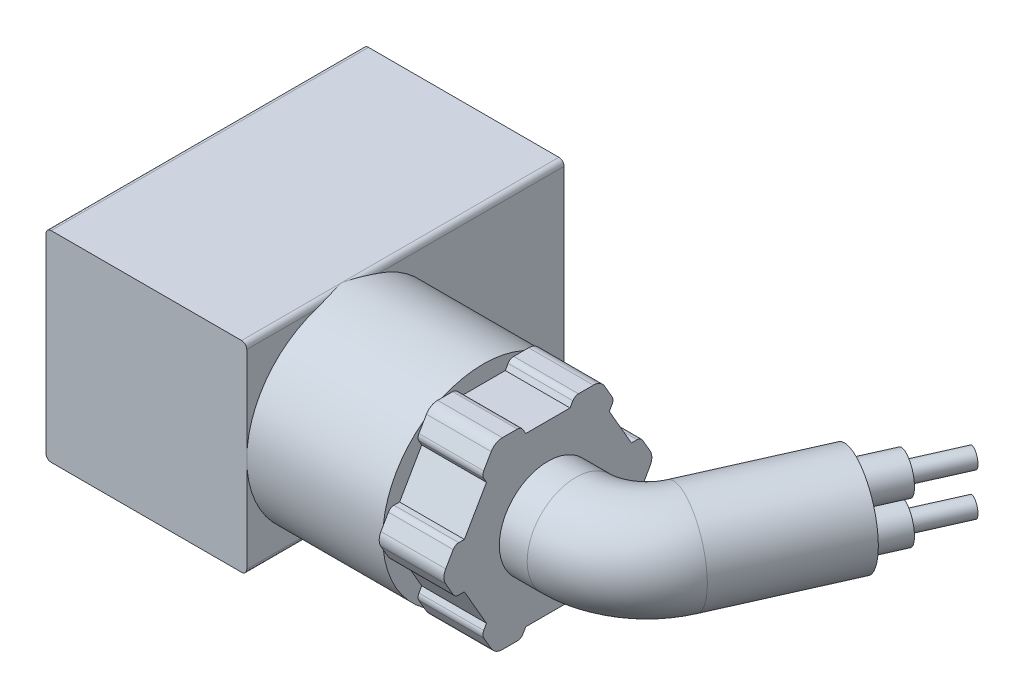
ISO-10303-21;
HEADER;
FILE_DESCRIPTION(('STEP AP214'),'2;1');
FILE_NAME('part.step','',(''),(''),'','','');
FILE_SCHEMA(('AUTOMOTIVE_DESIGN { 1 0 10303 214 1 1 1 1 }'));
ENDSEC;
DATA;
#1=APPLICATION_CONTEXT('core data for automotive mechanical design processes');
#2=APPLICATION_PROTOCOL_DEFINITION('international standard','automotive_design',2000,#1);
#3=PRODUCT_CONTEXT('',#1,'mechanical');
#4=PRODUCT('Part','Part','',(#3));
#5=PRODUCT_RELATED_PRODUCT_CATEGORY('part','',(#4));
#6=PRODUCT_DEFINITION_FORMATION('','',#4);
#7=PRODUCT_DEFINITION_CONTEXT('part definition',#1,'design');
#8=PRODUCT_DEFINITION('design','',#6,#7);
#9=PRODUCT_DEFINITION_SHAPE('','',#8);
#10=(LENGTH_UNIT() NAMED_UNIT(*) SI_UNIT(.MILLI.,.METRE.));
#11=(NAMED_UNIT(*) PLANE_ANGLE_UNIT() SI_UNIT($,.RADIAN.));
#12=(NAMED_UNIT(*) SI_UNIT($,.STERADIAN.) SOLID_ANGLE_UNIT());
#13=UNCERTAINTY_MEASURE_WITH_UNIT(LENGTH_MEASURE(1.E-05),#10,'distance_accuracy_value','');
#14=(GEOMETRIC_REPRESENTATION_CONTEXT(3) GLOBAL_UNCERTAINTY_ASSIGNED_CONTEXT((#13)) GLOBAL_UNIT_ASSIGNED_CONTEXT((#10,
#11,#12)) REPRESENTATION_CONTEXT('',''));
#15=CARTESIAN_POINT('',(0.,0.,0.));
#16=DIRECTION('',(0.,0.,1.));
#17=DIRECTION('',(1.,0.,0.));
#18=AXIS2_PLACEMENT_3D('',#15,#16,#17);
#19=CARTESIAN_POINT('',(37.32075204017,1.65,-2.03135597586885));
#20=DIRECTION('',(0.4067366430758,0.,-0.913545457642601));
#21=DIRECTION('',(-0.913545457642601,0.,-0.4067366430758));
#22=AXIS2_PLACEMENT_3D('',#19,#20,#21);
#23=PLANE('',#22);
#24=CARTESIAN_POINT('',(37.32075204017,1.65,-2.03135597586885));
#25=DIRECTION('',(0.4067366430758,0.,-0.913545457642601));
#26=DIRECTION('',(0.913545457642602,0.,0.406736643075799));
#27=AXIS2_PLACEMENT_3D('',#24,#25,#26);
#28=CIRCLE('',#27,0.7);
#29=CARTESIAN_POINT('',(37.9602338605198,1.65,-1.74664032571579));
#30=VERTEX_POINT('',#29);
#31=EDGE_CURVE('E475',#30,#30,#28,.T.);
#32=ORIENTED_EDGE('',*,*,#31,.T.);
#33=EDGE_LOOP('',(#32));
#34=FACE_BOUND('',#33,.T.);
#35=ADVANCED_FACE('F14',(#34),#23,.T.);
#36=CARTESIAN_POINT('',(37.32075204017,-1.65,-2.03135597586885));
#37=DIRECTION('',(0.4067366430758,0.,-0.913545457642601));
#38=DIRECTION('',(-0.913545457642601,0.,-0.4067366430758));
#39=AXIS2_PLACEMENT_3D('',#36,#37,#38);
#40=PLANE('',#39);
#41=CARTESIAN_POINT('',(37.32075204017,-1.65,-2.03135597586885));
#42=DIRECTION('',(0.4067366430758,0.,-0.913545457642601));
#43=DIRECTION('',(0.913545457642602,0.,0.406736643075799));
#44=AXIS2_PLACEMENT_3D('',#41,#42,#43);
#45=CIRCLE('',#44,0.7);
#46=CARTESIAN_POINT('',(37.9602338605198,-1.65,-1.74664032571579));
#47=VERTEX_POINT('',#46);
#48=EDGE_CURVE('E478',#47,#47,#45,.T.);
#49=ORIENTED_EDGE('',*,*,#48,.T.);
#50=EDGE_LOOP('',(#49));
#51=FACE_BOUND('',#50,.T.);
#52=ADVANCED_FACE('F1027',(#51),#40,.T.);
#53=CARTESIAN_POINT('',(37.32075204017,1.65,-2.03135597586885));
#54=DIRECTION('',(-0.4067366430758,0.,0.913545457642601));
#55=DIRECTION('',(0.913545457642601,0.,0.4067366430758));
#56=AXIS2_PLACEMENT_3D('',#53,#54,#55);
#57=CYLINDRICAL_SURFACE('',#56,0.7);
#58=CARTESIAN_POINT('',(35.693805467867,1.65,1.6228258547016));
#59=DIRECTION('',(0.4067366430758,0.,-0.913545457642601));
#60=DIRECTION('',(-0.913545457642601,0.,-0.4067366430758));
#61=AXIS2_PLACEMENT_3D('',#58,#59,#60);
#62=CIRCLE('',#61,0.7);
#63=CARTESIAN_POINT('',(35.0543236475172,1.65,1.33811020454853));
#64=VERTEX_POINT('',#63);
#65=EDGE_CURVE('E472',#64,#64,#62,.F.);
#66=ORIENTED_EDGE('',*,*,#65,.F.);
#67=EDGE_LOOP('',(#66));
#68=FACE_BOUND('',#67,.T.);
#69=ORIENTED_EDGE('',*,*,#31,.F.);
#70=EDGE_LOOP('',(#69));
#71=FACE_BOUND('',#70,.T.);
#72=ADVANCED_FACE('F1034',(#68,#71),#57,.T.);
#73=CARTESIAN_POINT('',(37.32075204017,-1.65,-2.03135597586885));
#74=DIRECTION('',(-0.4067366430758,0.,0.913545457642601));
#75=DIRECTION('',(0.913545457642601,0.,0.4067366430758));
#76=AXIS2_PLACEMENT_3D('',#73,#74,#75);
#77=CYLINDRICAL_SURFACE('',#76,0.7);
#78=CARTESIAN_POINT('',(35.693805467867,-1.65,1.6228258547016));
#79=DIRECTION('',(0.4067366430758,0.,-0.913545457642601));
#80=DIRECTION('',(-0.913545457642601,0.,-0.4067366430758));
#81=AXIS2_PLACEMENT_3D('',#78,#79,#80);
#82=CIRCLE('',#81,0.7);
#83=CARTESIAN_POINT('',(35.0543236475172,-1.65,1.33811020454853));
#84=VERTEX_POINT('',#83);
#85=EDGE_CURVE('E476',#84,#84,#82,.F.);
#86=ORIENTED_EDGE('',*,*,#85,.F.);
#87=EDGE_LOOP('',(#86));
#88=FACE_BOUND('',#87,.T.);
#89=ORIENTED_EDGE('',*,*,#48,.F.);
#90=EDGE_LOOP('',(#89));
#91=FACE_BOUND('',#90,.T.);
#92=ADVANCED_FACE('F1038',(#88,#91),#77,.T.);
#93=CARTESIAN_POINT('',(35.693805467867,1.65,1.6228258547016));
#94=DIRECTION('',(0.4067366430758,0.,-0.913545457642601));
#95=DIRECTION('',(-0.913545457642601,0.,-0.4067366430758));
#96=AXIS2_PLACEMENT_3D('',#93,#94,#95);
#97=PLANE('',#96);
#98=ORIENTED_EDGE('',*,*,#65,.T.);
#99=EDGE_LOOP('',(#98));
#100=FACE_BOUND('',#99,.T.);
#101=CARTESIAN_POINT('',(35.693805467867,1.65,1.6228258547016));
#102=DIRECTION('',(0.4067366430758,0.,-0.913545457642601));
#103=DIRECTION('',(0.913545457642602,0.,0.406736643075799));
#104=AXIS2_PLACEMENT_3D('',#101,#102,#103);
#105=CIRCLE('',#104,1.44);
#106=CARTESIAN_POINT('',(37.0093109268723,1.65,2.20852662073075));
#107=VERTEX_POINT('',#106);
#108=EDGE_CURVE('E497',#107,#107,#105,.T.);
#109=ORIENTED_EDGE('',*,*,#108,.T.);
#110=EDGE_LOOP('',(#109));
#111=FACE_BOUND('',#110,.T.);
#112=ADVANCED_FACE('F1046',(#100,#111),#97,.T.);
#113=CARTESIAN_POINT('',(35.693805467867,-1.65,1.6228258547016));
#114=DIRECTION('',(0.4067366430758,0.,-0.913545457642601));
#115=DIRECTION('',(-0.913545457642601,0.,-0.4067366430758));
#116=AXIS2_PLACEMENT_3D('',#113,#114,#115);
#117=PLANE('',#116);
#118=ORIENTED_EDGE('',*,*,#85,.T.);
#119=EDGE_LOOP('',(#118));
#120=FACE_BOUND('',#119,.T.);
#121=CARTESIAN_POINT('',(35.693805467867,-1.65,1.6228258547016));
#122=DIRECTION('',(0.4067366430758,0.,-0.913545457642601));
#123=DIRECTION('',(0.913545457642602,0.,0.406736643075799));
#124=AXIS2_PLACEMENT_3D('',#121,#122,#123);
#125=CIRCLE('',#124,1.44);
#126=CARTESIAN_POINT('',(37.0093109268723,-1.65,2.20852662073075));
#127=VERTEX_POINT('',#126);
#128=EDGE_CURVE('E491',#127,#127,#125,.T.);
#129=ORIENTED_EDGE('',*,*,#128,.T.);
#130=EDGE_LOOP('',(#129));
#131=FACE_BOUND('',#130,.T.);
#132=ADVANCED_FACE('F1042',(#120,#131),#117,.T.);
#133=CARTESIAN_POINT('',(35.693805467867,1.65,1.6228258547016));
#134=DIRECTION('',(-0.4067366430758,0.,0.913545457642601));
#135=DIRECTION('',(0.913545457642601,0.,0.4067366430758));
#136=AXIS2_PLACEMENT_3D('',#133,#134,#135);
#137=CYLINDRICAL_SURFACE('',#136,1.44);
#138=ORIENTED_EDGE('',*,*,#108,.F.);
#139=EDGE_LOOP('',(#138));
#140=FACE_BOUND('',#139,.T.);
#141=CARTESIAN_POINT('',(34.4735955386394,1.65,4.36346222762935));
#142=DIRECTION('',(0.4067366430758,0.,-0.913545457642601));
#143=DIRECTION('',(0.913545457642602,0.,0.406736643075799));
#144=AXIS2_PLACEMENT_3D('',#141,#142,#143);
#145=CIRCLE('',#144,1.44);
#146=CARTESIAN_POINT('',(35.7891009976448,1.65,4.9491629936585));
#147=VERTEX_POINT('',#146);
#148=EDGE_CURVE('E494',#147,#147,#145,.T.);
#149=ORIENTED_EDGE('',*,*,#148,.T.);
#150=EDGE_LOOP('',(#149));
#151=FACE_BOUND('',#150,.T.);
#152=ADVANCED_FACE('F1045',(#140,#151),#137,.T.);
#153=CARTESIAN_POINT('',(35.693805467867,-1.65,1.6228258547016));
#154=DIRECTION('',(-0.4067366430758,0.,0.913545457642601));
#155=DIRECTION('',(0.913545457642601,0.,0.4067366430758));
#156=AXIS2_PLACEMENT_3D('',#153,#154,#155);
#157=CYLINDRICAL_SURFACE('',#156,1.44);
#158=ORIENTED_EDGE('',*,*,#128,.F.);
#159=EDGE_LOOP('',(#158));
#160=FACE_BOUND('',#159,.T.);
#161=CARTESIAN_POINT('',(34.4735955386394,-1.65,4.36346222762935));
#162=DIRECTION('',(0.4067366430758,0.,-0.913545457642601));
#163=DIRECTION('',(0.913545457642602,0.,0.406736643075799));
#164=AXIS2_PLACEMENT_3D('',#161,#162,#163);
#165=CIRCLE('',#164,1.44);
#166=CARTESIAN_POINT('',(35.7891009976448,-1.65,4.9491629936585));
#167=VERTEX_POINT('',#166);
#168=EDGE_CURVE('E474',#167,#167,#165,.T.);
#169=ORIENTED_EDGE('',*,*,#168,.T.);
#170=EDGE_LOOP('',(#169));
#171=FACE_BOUND('',#170,.T.);
#172=ADVANCED_FACE('F1047',(#160,#171),#157,.T.);
#173=CARTESIAN_POINT('',(34.4735955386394,0.,4.3634622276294));
#174=DIRECTION('',(0.4067366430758,0.,-0.913545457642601));
#175=DIRECTION('',(-0.913545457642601,0.,-0.4067366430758));
#176=AXIS2_PLACEMENT_3D('',#173,#174,#175);
#177=PLANE('',#176);
#178=ORIENTED_EDGE('',*,*,#168,.F.);
#179=EDGE_LOOP('',(#178));
#180=FACE_BOUND('',#179,.T.);
#181=ORIENTED_EDGE('',*,*,#148,.F.);
#182=EDGE_LOOP('',(#181));
#183=FACE_BOUND('',#182,.T.);
#184=CARTESIAN_POINT('',(34.4735955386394,0.,4.3634622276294));
#185=DIRECTION('',(0.4067366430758,0.,-0.913545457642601));
#186=DIRECTION('',(0.913545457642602,0.,0.406736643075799));
#187=AXIS2_PLACEMENT_3D('',#184,#185,#186);
#188=CIRCLE('',#187,3.75);
#189=CARTESIAN_POINT('',(37.8993910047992,0.,5.88872463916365));
#190=VERTEX_POINT('',#189);
#191=EDGE_CURVE('E500',#190,#190,#188,.T.);
#192=ORIENTED_EDGE('',*,*,#191,.T.);
#193=EDGE_LOOP('',(#192));
#194=FACE_BOUND('',#193,.T.);
#195=ADVANCED_FACE('F1050',(#180,#183,#194),#177,.T.);
#196=CARTESIAN_POINT('',(34.4735955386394,0.,4.3634622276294));
#197=DIRECTION('',(-0.4067366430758,0.,0.913545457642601));
#198=DIRECTION('',(0.913545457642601,0.,0.4067366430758));
#199=AXIS2_PLACEMENT_3D('',#196,#197,#198);
#200=CYLINDRICAL_SURFACE('',#199,3.75);
#201=ORIENTED_EDGE('',*,*,#191,.F.);
#202=EDGE_LOOP('',(#201));
#203=FACE_BOUND('',#202,.T.);
#204=CARTESIAN_POINT('',(30.4062291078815,0.,13.4989168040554));
#205=DIRECTION('',(0.4067366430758,0.,-0.913545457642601));
#206=DIRECTION('',(0.913545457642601,0.,0.4067366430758));
#207=AXIS2_PLACEMENT_3D('',#204,#205,#206);
#208=CIRCLE('',#207,3.75);
#209=CARTESIAN_POINT('',(33.8320245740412,0.,15.0241792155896));
#210=VERTEX_POINT('',#209);
#211=EDGE_CURVE('E505',#210,#210,#208,.T.);
#212=ORIENTED_EDGE('',*,*,#211,.T.);
#213=EDGE_LOOP('',(#212));
#214=FACE_BOUND('',#213,.T.);
#215=ADVANCED_FACE('F1060',(#203,#214),#200,.T.);
#216=CARTESIAN_POINT('',(25.4,0.,11.27));
#217=DIRECTION('',(0.,1.,0.));
#218=DIRECTION('',(0.,0.,1.));
#219=AXIS2_PLACEMENT_3D('',#216,#217,#218);
#220=TOROIDAL_SURFACE('',#219,5.48,3.75);
#221=CARTESIAN_POINT('',(25.4,0.,16.75));
#222=DIRECTION('',(1.,0.,0.));
#223=DIRECTION('',(0.,0.,1.));
#224=AXIS2_PLACEMENT_3D('',#221,#222,#223);
#225=CIRCLE('',#224,3.75);
#226=CARTESIAN_POINT('',(25.4,0.,20.5));
#227=VERTEX_POINT('',#226);
#228=EDGE_CURVE('E509',#227,#227,#225,.T.);
#229=CARTESIAN_POINT('',(25.4,0.,11.27));
#230=DIRECTION('',(0.,1.,0.));
#231=DIRECTION('',(0.,0.,1.));
#232=AXIS2_PLACEMENT_3D('',#229,#230,#231);
#233=CIRCLE('',#232,9.23);
#234=EDGE_CURVE('',#227,#210,#233,.T.);
#235=ORIENTED_EDGE('',*,*,#228,.T.);
#236=ORIENTED_EDGE('',*,*,#211,.F.);
#237=ORIENTED_EDGE('',*,*,#234,.T.);
#238=ORIENTED_EDGE('',*,*,#234,.F.);
#239=EDGE_LOOP('',(#235,#237,#236,#238));
#240=FACE_BOUND('',#239,.T.);
#241=ADVANCED_FACE('F1064',(#240),#220,.T.);
#242=CARTESIAN_POINT('',(25.4,0.,16.75));
#243=DIRECTION('',(-1.,0.,0.));
#244=DIRECTION('',(0.,-1.,0.));
#245=AXIS2_PLACEMENT_3D('',#242,#243,#244);
#246=CYLINDRICAL_SURFACE('',#245,3.75);
#247=ORIENTED_EDGE('',*,*,#228,.F.);
#248=EDGE_LOOP('',(#247));
#249=FACE_BOUND('',#248,.T.);
#250=CARTESIAN_POINT('',(23.25,0.,16.75));
#251=DIRECTION('',(1.,0.,0.));
#252=DIRECTION('',(0.,0.,1.));
#253=AXIS2_PLACEMENT_3D('',#250,#251,#252);
#254=CIRCLE('',#253,3.75);
#255=CARTESIAN_POINT('',(23.25,0.,20.5));
#256=VERTEX_POINT('',#255);
#257=EDGE_CURVE('E508',#256,#256,#254,.T.);
#258=ORIENTED_EDGE('',*,*,#257,.T.);
#259=EDGE_LOOP('',(#258));
#260=FACE_BOUND('',#259,.T.);
#261=ADVANCED_FACE('F1068',(#249,#260),#246,.T.);
#262=CARTESIAN_POINT('',(23.25,0.,9.725));
#263=DIRECTION('',(1.,0.,0.));
#264=DIRECTION('',(0.,1.,0.));
#265=AXIS2_PLACEMENT_3D('',#262,#263,#264);
#266=PLANE('',#265);
#267=ORIENTED_EDGE('',*,*,#257,.F.);
#268=EDGE_LOOP('',(#267));
#269=FACE_BOUND('',#268,.T.);
#270=DIRECTION('',(0.,0.866025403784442,-0.499999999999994));
#271=VECTOR('',#270,1.);
#272=CARTESIAN_POINT('',(23.25,-1.5,9.43632486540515));
#273=LINE('',#272,#271);
#274=CARTESIAN_POINT('',(23.25,-1.5,9.43632486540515));
#275=VERTEX_POINT('',#274);
#276=CARTESIAN_POINT('',(23.25,-0.5,8.85897459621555));
#277=VERTEX_POINT('',#276);
#278=EDGE_CURVE('E512',#275,#277,#273,.T.);
#279=ORIENTED_EDGE('',*,*,#278,.T.);
#280=CARTESIAN_POINT('',(23.25,0.,9.725));
#281=DIRECTION('',(1.,0.,0.));
#282=DIRECTION('',(0.,0.,1.));
#283=AXIS2_PLACEMENT_3D('',#280,#281,#282);
#284=CIRCLE('',#283,1.00000000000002);
#285=CARTESIAN_POINT('',(23.25,0.5,8.85897459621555));
#286=VERTEX_POINT('',#285);
#287=EDGE_CURVE('E666',#277,#286,#284,.T.);
#288=ORIENTED_EDGE('',*,*,#287,.T.);
#289=DIRECTION('',(0.,0.866025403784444,0.499999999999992));
#290=VECTOR('',#289,1.);
#291=CARTESIAN_POINT('',(23.25,0.5,8.85897459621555));
#292=LINE('',#291,#290);
#293=CARTESIAN_POINT('',(23.25,1.5,9.43632486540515));
#294=VERTEX_POINT('',#293);
#295=EDGE_CURVE('E669',#286,#294,#292,.T.);
#296=ORIENTED_EDGE('',*,*,#295,.T.);
#297=CARTESIAN_POINT('',(23.25,1.25,9.8693375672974));
#298=DIRECTION('',(1.,0.,0.));
#299=DIRECTION('',(0.,0.,1.));
#300=AXIS2_PLACEMENT_3D('',#297,#298,#299);
#301=CIRCLE('',#300,0.5);
#302=CARTESIAN_POINT('',(23.25,1.75,9.8693375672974));
#303=VERTEX_POINT('',#302);
#304=EDGE_CURVE('E672',#294,#303,#301,.T.);
#305=ORIENTED_EDGE('',*,*,#304,.T.);
#306=DIRECTION('',(0.,0.,1.));
#307=VECTOR('',#306,1.);
#308=CARTESIAN_POINT('',(23.25,1.75,9.8693375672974));
#309=LINE('',#308,#307);
#310=CARTESIAN_POINT('',(23.25,1.75,10.3));
#311=VERTEX_POINT('',#310);
#312=EDGE_CURVE('E675',#303,#311,#309,.T.);
#313=ORIENTED_EDGE('',*,*,#312,.T.);
#314=DIRECTION('',(0.,0.866025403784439,0.5));
#315=VECTOR('',#314,1.);
#316=CARTESIAN_POINT('',(23.25,1.75,10.3));
#317=LINE('',#316,#315);
#318=CARTESIAN_POINT('',(23.25,4.71086385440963,12.0094555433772));
#319=VERTEX_POINT('',#318);
#320=EDGE_CURVE('E678',#311,#319,#317,.T.);
#321=ORIENTED_EDGE('',*,*,#320,.T.);
#322=DIRECTION('',(0.,0.866025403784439,-0.5));
#323=VECTOR('',#322,1.);
#324=CARTESIAN_POINT('',(23.25,4.71086385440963,12.0094555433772));
#325=LINE('',#324,#323);
#326=CARTESIAN_POINT('',(23.25,5.0838284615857,11.7941243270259));
#327=VERTEX_POINT('',#326);
#328=EDGE_CURVE('E681',#319,#327,#325,.T.);
#329=ORIENTED_EDGE('',*,*,#328,.T.);
#330=CARTESIAN_POINT('',(23.25,5.33382846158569,12.2271370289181));
#331=DIRECTION('',(1.,0.,0.));
#332=DIRECTION('',(0.,0.,1.));
#333=AXIS2_PLACEMENT_3D('',#330,#331,#332);
#334=CIRCLE('',#333,0.5);
#335=CARTESIAN_POINT('',(23.25,5.5838284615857,11.7941243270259));
#336=VERTEX_POINT('',#335);
#337=EDGE_CURVE('E684',#327,#336,#334,.T.);
#338=ORIENTED_EDGE('',*,*,#337,.T.);
#339=DIRECTION('',(0.,0.866025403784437,0.5));
#340=VECTOR('',#339,1.);
#341=CARTESIAN_POINT('',(23.25,5.5838284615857,11.7941243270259));
#342=LINE('',#341,#340);
#343=CARTESIAN_POINT('',(23.25,6.58382846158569,12.3714745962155));
#344=VERTEX_POINT('',#343);
#345=EDGE_CURVE('E687',#336,#344,#342,.T.);
#346=ORIENTED_EDGE('',*,*,#345,.T.);
#347=CARTESIAN_POINT('',(23.25,6.0838284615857,13.2375));
#348=DIRECTION('',(1.,0.,0.));
#349=DIRECTION('',(0.,0.,1.));
#350=AXIS2_PLACEMENT_3D('',#347,#348,#349);
#351=CIRCLE('',#350,1.);
#352=CARTESIAN_POINT('',(23.25,7.08382846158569,13.2375));
#353=VERTEX_POINT('',#352);
#354=EDGE_CURVE('E690',#344,#353,#351,.T.);
#355=ORIENTED_EDGE('',*,*,#354,.T.);
#356=DIRECTION('',(0.,0.,1.));
#357=VECTOR('',#356,1.);
#358=CARTESIAN_POINT('',(23.25,7.08382846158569,13.2375));
#359=LINE('',#358,#357);
#360=CARTESIAN_POINT('',(23.25,7.0838284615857,14.3922005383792));
#361=VERTEX_POINT('',#360);
#362=EDGE_CURVE('E693',#353,#361,#359,.T.);
#363=ORIENTED_EDGE('',*,*,#362,.T.);
#364=CARTESIAN_POINT('',(23.25,6.5838284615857,14.3922005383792));
#365=DIRECTION('',(1.,0.,0.));
#366=DIRECTION('',(0.,0.,1.));
#367=AXIS2_PLACEMENT_3D('',#364,#365,#366);
#368=CIRCLE('',#367,0.5);
#369=CARTESIAN_POINT('',(23.25,6.8338284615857,14.8252132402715));
#370=VERTEX_POINT('',#369);
#371=EDGE_CURVE('E696',#361,#370,#368,.T.);
#372=ORIENTED_EDGE('',*,*,#371,.T.);
#373=DIRECTION('',(0.,-0.86602540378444,0.5));
#374=VECTOR('',#373,1.);
#375=CARTESIAN_POINT('',(23.25,6.8338284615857,14.8252132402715));
#376=LINE('',#375,#374);
#377=CARTESIAN_POINT('',(23.25,6.46086385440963,15.0405444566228));
#378=VERTEX_POINT('',#377);
#379=EDGE_CURVE('E699',#370,#378,#376,.T.);
#380=ORIENTED_EDGE('',*,*,#379,.T.);
#381=DIRECTION('',(0.,0.,1.));
#382=VECTOR('',#381,1.);
#383=CARTESIAN_POINT('',(23.25,6.46086385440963,15.0405444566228));
#384=LINE('',#383,#382);
#385=CARTESIAN_POINT('',(23.25,6.46086385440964,18.4594555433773));
#386=VERTEX_POINT('',#385);
#387=EDGE_CURVE('E702',#378,#386,#384,.T.);
#388=ORIENTED_EDGE('',*,*,#387,.T.);
#389=DIRECTION('',(0.,0.866025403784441,0.5));
#390=VECTOR('',#389,1.);
#391=CARTESIAN_POINT('',(23.25,6.46086385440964,18.4594555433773));
#392=LINE('',#391,#390);
#393=CARTESIAN_POINT('',(23.25,6.8338284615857,18.6747867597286));
#394=VERTEX_POINT('',#393);
#395=EDGE_CURVE('E705',#386,#394,#392,.T.);
#396=ORIENTED_EDGE('',*,*,#395,.T.);
#397=CARTESIAN_POINT('',(23.25,6.5838284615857,19.1077994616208));
#398=DIRECTION('',(1.,0.,0.));
#399=DIRECTION('',(0.,0.,1.));
#400=AXIS2_PLACEMENT_3D('',#397,#398,#399);
#401=CIRCLE('',#400,0.5);
#402=CARTESIAN_POINT('',(23.25,7.0838284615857,19.1077994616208));
#403=VERTEX_POINT('',#402);
#404=EDGE_CURVE('E708',#394,#403,#401,.T.);
#405=ORIENTED_EDGE('',*,*,#404,.T.);
#406=DIRECTION('',(0.,0.,1.));
#407=VECTOR('',#406,1.);
#408=CARTESIAN_POINT('',(23.25,7.0838284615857,19.1077994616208));
#409=LINE('',#408,#407);
#410=CARTESIAN_POINT('',(23.25,7.08382846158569,20.2625));
#411=VERTEX_POINT('',#410);
#412=EDGE_CURVE('E711',#403,#411,#409,.T.);
#413=ORIENTED_EDGE('',*,*,#412,.T.);
#414=CARTESIAN_POINT('',(23.25,6.08382846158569,20.2625));
#415=DIRECTION('',(1.,0.,0.));
#416=DIRECTION('',(0.,0.,1.));
#417=AXIS2_PLACEMENT_3D('',#414,#415,#416);
#418=CIRCLE('',#417,1.);
#419=CARTESIAN_POINT('',(23.25,6.5838284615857,21.1285254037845));
#420=VERTEX_POINT('',#419);
#421=EDGE_CURVE('E714',#411,#420,#418,.T.);
#422=ORIENTED_EDGE('',*,*,#421,.T.);
#423=DIRECTION('',(0.,-0.866025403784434,0.500000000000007));
#424=VECTOR('',#423,1.);
#425=CARTESIAN_POINT('',(23.25,6.5838284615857,21.1285254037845));
#426=LINE('',#425,#424);
#427=CARTESIAN_POINT('',(23.25,5.5838284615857,21.7058756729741));
#428=VERTEX_POINT('',#427);
#429=EDGE_CURVE('E717',#420,#428,#426,.T.);
#430=ORIENTED_EDGE('',*,*,#429,.T.);
#431=CARTESIAN_POINT('',(23.25,5.3338284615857,21.2728629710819));
#432=DIRECTION('',(1.,0.,0.));
#433=DIRECTION('',(0.,0.,1.));
#434=AXIS2_PLACEMENT_3D('',#431,#432,#433);
#435=CIRCLE('',#434,0.500000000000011);
#436=CARTESIAN_POINT('',(23.25,5.0838284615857,21.7058756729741));
#437=VERTEX_POINT('',#436);
#438=EDGE_CURVE('E720',#428,#437,#435,.T.);
#439=ORIENTED_EDGE('',*,*,#438,.T.);
#440=DIRECTION('',(0.,-0.866025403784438,-0.5));
#441=VECTOR('',#440,1.);
#442=CARTESIAN_POINT('',(23.25,5.0838284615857,21.7058756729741));
#443=LINE('',#442,#441);
#444=CARTESIAN_POINT('',(23.25,4.71086385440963,21.4905444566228));
#445=VERTEX_POINT('',#444);
#446=EDGE_CURVE('E723',#437,#445,#443,.T.);
#447=ORIENTED_EDGE('',*,*,#446,.T.);
#448=DIRECTION('',(0.,-0.866025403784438,0.5));
#449=VECTOR('',#448,1.);
#450=CARTESIAN_POINT('',(23.25,4.71086385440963,21.4905444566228));
#451=LINE('',#450,#449);
#452=CARTESIAN_POINT('',(23.25,1.75,23.2));
#453=VERTEX_POINT('',#452);
#454=EDGE_CURVE('E726',#445,#453,#451,.T.);
#455=ORIENTED_EDGE('',*,*,#454,.T.);
#456=DIRECTION('',(0.,0.,1.));
#457=VECTOR('',#456,1.);
#458=CARTESIAN_POINT('',(23.25,1.75,23.2));
#459=LINE('',#458,#457);
#460=CARTESIAN_POINT('',(23.25,1.75,23.6306624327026));
#461=VERTEX_POINT('',#460);
#462=EDGE_CURVE('E729',#453,#461,#459,.T.);
#463=ORIENTED_EDGE('',*,*,#462,.T.);
#464=CARTESIAN_POINT('',(23.25,1.25,23.6306624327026));
#465=DIRECTION('',(1.,0.,0.));
#466=DIRECTION('',(0.,0.,1.));
#467=AXIS2_PLACEMENT_3D('',#464,#465,#466);
#468=CIRCLE('',#467,0.5);
#469=CARTESIAN_POINT('',(23.25,1.5,24.0636751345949));
#470=VERTEX_POINT('',#469);
#471=EDGE_CURVE('E732',#461,#470,#468,.T.);
#472=ORIENTED_EDGE('',*,*,#471,.T.);
#473=DIRECTION('',(0.,-0.866025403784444,0.499999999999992));
#474=VECTOR('',#473,1.);
#475=CARTESIAN_POINT('',(23.25,1.5,24.0636751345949));
#476=LINE('',#475,#474);
#477=CARTESIAN_POINT('',(23.25,0.5,24.6410254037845));
#478=VERTEX_POINT('',#477);
#479=EDGE_CURVE('E735',#470,#478,#476,.T.);
#480=ORIENTED_EDGE('',*,*,#479,.T.);
#481=CARTESIAN_POINT('',(23.25,0.,23.775));
#482=DIRECTION('',(1.,0.,0.));
#483=DIRECTION('',(0.,0.,1.));
#484=AXIS2_PLACEMENT_3D('',#481,#482,#483);
#485=CIRCLE('',#484,1.);
#486=CARTESIAN_POINT('',(23.25,-0.5,24.6410254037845));
#487=VERTEX_POINT('',#486);
#488=EDGE_CURVE('E738',#478,#487,#485,.T.);
#489=ORIENTED_EDGE('',*,*,#488,.T.);
#490=DIRECTION('',(0.,-0.866025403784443,-0.499999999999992));
#491=VECTOR('',#490,1.);
#492=CARTESIAN_POINT('',(23.25,-0.5,24.6410254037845));
#493=LINE('',#492,#491);
#494=CARTESIAN_POINT('',(23.25,-1.5,24.0636751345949));
#495=VERTEX_POINT('',#494);
#496=EDGE_CURVE('E741',#487,#495,#493,.T.);
#497=ORIENTED_EDGE('',*,*,#496,.T.);
#498=CARTESIAN_POINT('',(23.25,-1.25,23.6306624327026));
#499=DIRECTION('',(1.,0.,0.));
#500=DIRECTION('',(0.,0.,1.));
#501=AXIS2_PLACEMENT_3D('',#498,#499,#500);
#502=CIRCLE('',#501,0.5);
#503=CARTESIAN_POINT('',(23.25,-1.75,23.6306624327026));
#504=VERTEX_POINT('',#503);
#505=EDGE_CURVE('E744',#495,#504,#502,.T.);
#506=ORIENTED_EDGE('',*,*,#505,.T.);
#507=DIRECTION('',(0.,0.,-1.));
#508=VECTOR('',#507,1.);
#509=CARTESIAN_POINT('',(23.25,-1.75,23.6306624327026));
#510=LINE('',#509,#508);
#511=CARTESIAN_POINT('',(23.25,-1.75,23.2));
#512=VERTEX_POINT('',#511);
#513=EDGE_CURVE('E747',#504,#512,#510,.T.);
#514=ORIENTED_EDGE('',*,*,#513,.T.);
#515=DIRECTION('',(0.,-0.866025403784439,-0.5));
#516=VECTOR('',#515,1.);
#517=CARTESIAN_POINT('',(23.25,-1.75,23.2));
#518=LINE('',#517,#516);
#519=CARTESIAN_POINT('',(23.25,-4.71086385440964,21.4905444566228));
#520=VERTEX_POINT('',#519);
#521=EDGE_CURVE('E750',#512,#520,#518,.T.);
#522=ORIENTED_EDGE('',*,*,#521,.T.);
#523=DIRECTION('',(0.,-0.866025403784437,0.5));
#524=VECTOR('',#523,1.);
#525=CARTESIAN_POINT('',(23.25,-4.71086385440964,21.4905444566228));
#526=LINE('',#525,#524);
#527=CARTESIAN_POINT('',(23.25,-5.0838284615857,21.7058756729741));
#528=VERTEX_POINT('',#527);
#529=EDGE_CURVE('E753',#520,#528,#526,.T.);
#530=ORIENTED_EDGE('',*,*,#529,.T.);
#531=CARTESIAN_POINT('',(23.25,-5.3338284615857,21.2728629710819));
#532=DIRECTION('',(1.,0.,0.));
#533=DIRECTION('',(0.,0.,1.));
#534=AXIS2_PLACEMENT_3D('',#531,#532,#533);
#535=CIRCLE('',#534,0.499999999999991);
#536=CARTESIAN_POINT('',(23.25,-5.5838284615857,21.7058756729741));
#537=VERTEX_POINT('',#536);
#538=EDGE_CURVE('E756',#528,#537,#535,.T.);
#539=ORIENTED_EDGE('',*,*,#538,.T.);
#540=DIRECTION('',(0.,-0.866025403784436,-0.5));
#541=VECTOR('',#540,1.);
#542=CARTESIAN_POINT('',(23.25,-5.5838284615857,21.7058756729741));
#543=LINE('',#542,#541);
#544=CARTESIAN_POINT('',(23.25,-6.5838284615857,21.1285254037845));
#545=VERTEX_POINT('',#544);
#546=EDGE_CURVE('E759',#537,#545,#543,.T.);
#547=ORIENTED_EDGE('',*,*,#546,.T.);
#548=CARTESIAN_POINT('',(23.25,-6.0838284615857,20.2625));
#549=DIRECTION('',(1.,0.,0.));
#550=DIRECTION('',(0.,0.,1.));
#551=AXIS2_PLACEMENT_3D('',#548,#549,#550);
#552=CIRCLE('',#551,1.);
#553=CARTESIAN_POINT('',(23.25,-7.0838284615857,20.2625));
#554=VERTEX_POINT('',#553);
#555=EDGE_CURVE('E762',#545,#554,#552,.T.);
#556=ORIENTED_EDGE('',*,*,#555,.T.);
#557=DIRECTION('',(0.,0.,-1.));
#558=VECTOR('',#557,1.);
#559=CARTESIAN_POINT('',(23.25,-7.0838284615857,20.2625));
#560=LINE('',#559,#558);
#561=CARTESIAN_POINT('',(23.25,-7.0838284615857,19.1077994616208));
#562=VERTEX_POINT('',#561);
#563=EDGE_CURVE('E765',#554,#562,#560,.T.);
#564=ORIENTED_EDGE('',*,*,#563,.T.);
#565=CARTESIAN_POINT('',(23.25,-6.5838284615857,19.1077994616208));
#566=DIRECTION('',(1.,0.,0.));
#567=DIRECTION('',(0.,0.,1.));
#568=AXIS2_PLACEMENT_3D('',#565,#566,#567);
#569=CIRCLE('',#568,0.5);
#570=CARTESIAN_POINT('',(23.25,-6.8338284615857,18.6747867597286));
#571=VERTEX_POINT('',#570);
#572=EDGE_CURVE('E768',#562,#571,#569,.T.);
#573=ORIENTED_EDGE('',*,*,#572,.T.);
#574=DIRECTION('',(0.,0.866025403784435,-0.500000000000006));
#575=VECTOR('',#574,1.);
#576=CARTESIAN_POINT('',(23.25,-6.8338284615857,18.6747867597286));
#577=LINE('',#576,#575);
#578=CARTESIAN_POINT('',(23.25,-6.46086385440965,18.4594555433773));
#579=VERTEX_POINT('',#578);
#580=EDGE_CURVE('E771',#571,#579,#577,.T.);
#581=ORIENTED_EDGE('',*,*,#580,.T.);
#582=DIRECTION('',(0.,0.,-1.));
#583=VECTOR('',#582,1.);
#584=CARTESIAN_POINT('',(23.25,-6.46086385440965,18.4594555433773));
#585=LINE('',#584,#583);
#586=CARTESIAN_POINT('',(23.25,-6.46086385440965,15.0405444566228));
#587=VERTEX_POINT('',#586);
#588=EDGE_CURVE('E774',#579,#587,#585,.T.);
#589=ORIENTED_EDGE('',*,*,#588,.T.);
#590=DIRECTION('',(0.,-0.866025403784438,-0.5));
#591=VECTOR('',#590,1.);
#592=CARTESIAN_POINT('',(23.25,-6.46086385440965,15.0405444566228));
#593=LINE('',#592,#591);
#594=CARTESIAN_POINT('',(23.25,-6.8338284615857,14.8252132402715));
#595=VERTEX_POINT('',#594);
#596=EDGE_CURVE('E777',#587,#595,#593,.T.);
#597=ORIENTED_EDGE('',*,*,#596,.T.);
#598=CARTESIAN_POINT('',(23.25,-6.5838284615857,14.3922005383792));
#599=DIRECTION('',(1.,0.,0.));
#600=DIRECTION('',(0.,0.,1.));
#601=AXIS2_PLACEMENT_3D('',#598,#599,#600);
#602=CIRCLE('',#601,0.499999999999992);
#603=CARTESIAN_POINT('',(23.25,-7.0838284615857,14.3922005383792));
#604=VERTEX_POINT('',#603);
#605=EDGE_CURVE('E780',#595,#604,#602,.T.);
#606=ORIENTED_EDGE('',*,*,#605,.T.);
#607=DIRECTION('',(0.,0.,-1.));
#608=VECTOR('',#607,1.);
#609=CARTESIAN_POINT('',(23.25,-7.0838284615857,14.3922005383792));
#610=LINE('',#609,#608);
#611=CARTESIAN_POINT('',(23.25,-7.0838284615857,13.2375));
#612=VERTEX_POINT('',#611);
#613=EDGE_CURVE('E783',#604,#612,#610,.T.);
#614=ORIENTED_EDGE('',*,*,#613,.T.);
#615=CARTESIAN_POINT('',(23.25,-6.0838284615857,13.2375));
#616=DIRECTION('',(1.,0.,0.));
#617=DIRECTION('',(0.,0.,1.));
#618=AXIS2_PLACEMENT_3D('',#615,#616,#617);
#619=CIRCLE('',#618,0.999999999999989);
#620=CARTESIAN_POINT('',(23.25,-6.5838284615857,12.3714745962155));
#621=VERTEX_POINT('',#620);
#622=EDGE_CURVE('E786',#612,#621,#619,.T.);
#623=ORIENTED_EDGE('',*,*,#622,.T.);
#624=DIRECTION('',(0.,0.866025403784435,-0.5));
#625=VECTOR('',#624,1.);
#626=CARTESIAN_POINT('',(23.25,-6.5838284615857,12.3714745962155));
#627=LINE('',#626,#625);
#628=CARTESIAN_POINT('',(23.25,-5.5838284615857,11.7941243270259));
#629=VERTEX_POINT('',#628);
#630=EDGE_CURVE('E789',#621,#629,#627,.T.);
#631=ORIENTED_EDGE('',*,*,#630,.T.);
#632=CARTESIAN_POINT('',(23.25,-5.3338284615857,12.2271370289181));
#633=DIRECTION('',(1.,0.,0.));
#634=DIRECTION('',(0.,0.,1.));
#635=AXIS2_PLACEMENT_3D('',#632,#633,#634);
#636=CIRCLE('',#635,0.5);
#637=CARTESIAN_POINT('',(23.25,-5.0838284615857,11.7941243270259));
#638=VERTEX_POINT('',#637);
#639=EDGE_CURVE('E792',#629,#638,#636,.T.);
#640=ORIENTED_EDGE('',*,*,#639,.T.);
#641=DIRECTION('',(0.,0.866025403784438,0.5));
#642=VECTOR('',#641,1.);
#643=CARTESIAN_POINT('',(23.25,-5.0838284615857,11.7941243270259));
#644=LINE('',#643,#642);
#645=CARTESIAN_POINT('',(23.25,-4.71086385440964,12.0094555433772));
#646=VERTEX_POINT('',#645);
#647=EDGE_CURVE('E795',#638,#646,#644,.T.);
#648=ORIENTED_EDGE('',*,*,#647,.T.);
#649=DIRECTION('',(0.,0.866025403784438,-0.5));
#650=VECTOR('',#649,1.);
#651=CARTESIAN_POINT('',(23.25,-4.71086385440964,12.0094555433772));
#652=LINE('',#651,#650);
#653=CARTESIAN_POINT('',(23.25,-1.75,10.3));
#654=VERTEX_POINT('',#653);
#655=EDGE_CURVE('E798',#646,#654,#652,.T.);
#656=ORIENTED_EDGE('',*,*,#655,.T.);
#657=DIRECTION('',(0.,0.,-1.));
#658=VECTOR('',#657,1.);
#659=CARTESIAN_POINT('',(23.25,-1.75,10.3));
#660=LINE('',#659,#658);
#661=CARTESIAN_POINT('',(23.25,-1.75,9.8693375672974));
#662=VERTEX_POINT('',#661);
#663=EDGE_CURVE('E801',#654,#662,#660,.T.);
#664=ORIENTED_EDGE('',*,*,#663,.T.);
#665=CARTESIAN_POINT('',(23.25,-1.25,9.8693375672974));
#666=DIRECTION('',(1.,0.,0.));
#667=DIRECTION('',(0.,0.,1.));
#668=AXIS2_PLACEMENT_3D('',#665,#666,#667);
#669=CIRCLE('',#668,0.5);
#670=EDGE_CURVE('E804',#662,#275,#669,.T.);
#671=ORIENTED_EDGE('',*,*,#670,.T.);
#672=EDGE_LOOP('',(#279,#288,#296,#305,#313,#321,#329,#338,#346,#355,#363,#372,#380,#388,#396,
#405,#413,#422,#430,#439,#447,#455,#463,#472,#480,#489,#497,#506,#514,#522,#530,#539,#547,#556,
#564,#573,#581,#589,#597,#606,#614,#623,#631,#640,#648,#656,#664,#671));
#673=FACE_BOUND('',#672,.T.);
#674=ADVANCED_FACE('F1072',(#269,#673),#266,.T.);
#675=CARTESIAN_POINT('',(18.25,-6.0838284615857,20.2625));
#676=DIRECTION('',(1.,0.,0.));
#677=DIRECTION('',(0.,1.,0.));
#678=AXIS2_PLACEMENT_3D('',#675,#676,#677);
#679=CYLINDRICAL_SURFACE('',#678,1.);
#680=ORIENTED_EDGE('',*,*,#555,.F.);
#681=DIRECTION('',(1.,0.,0.));
#682=VECTOR('',#681,1.);
#683=CARTESIAN_POINT('',(18.25,-6.5838284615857,21.1285254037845));
#684=LINE('',#683,#682);
#685=CARTESIAN_POINT('',(18.25,-6.5838284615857,21.1285254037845));
#686=VERTEX_POINT('',#685);
#687=EDGE_CURVE('E836',#686,#545,#684,.T.);
#688=ORIENTED_EDGE('',*,*,#687,.F.);
#689=CARTESIAN_POINT('',(18.25,-6.0838284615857,20.2625));
#690=DIRECTION('',(1.,0.,0.));
#691=DIRECTION('',(0.,0.,1.));
#692=AXIS2_PLACEMENT_3D('',#689,#690,#691);
#693=CIRCLE('',#692,1.);
#694=CARTESIAN_POINT('',(18.25,-7.0838284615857,20.2625));
#695=VERTEX_POINT('',#694);
#696=EDGE_CURVE('E619',#686,#695,#693,.T.);
#697=ORIENTED_EDGE('',*,*,#696,.T.);
#698=DIRECTION('',(1.,0.,0.));
#699=VECTOR('',#698,1.);
#700=CARTESIAN_POINT('',(18.25,-7.0838284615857,20.2625));
#701=LINE('',#700,#699);
#702=EDGE_CURVE('E834',#695,#554,#701,.T.);
#703=ORIENTED_EDGE('',*,*,#702,.T.);
#704=EDGE_LOOP('',(#680,#688,#697,#703));
#705=FACE_BOUND('',#704,.T.);
#706=ADVANCED_FACE('F1084',(#705),#679,.T.);
#707=CARTESIAN_POINT('',(18.25,-6.8338284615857,18.6747867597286));
#708=DIRECTION('',(0.,-0.500000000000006,-0.866025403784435));
#709=DIRECTION('',(0.,0.866025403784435,-0.500000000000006));
#710=AXIS2_PLACEMENT_3D('',#707,#708,#709);
#711=PLANE('',#710);
#712=ORIENTED_EDGE('',*,*,#580,.F.);
#713=DIRECTION('',(1.,0.,0.));
#714=VECTOR('',#713,1.);
#715=CARTESIAN_POINT('',(18.25,-6.8338284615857,18.6747867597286));
#716=LINE('',#715,#714);
#717=CARTESIAN_POINT('',(18.25,-6.8338284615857,18.6747867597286));
#718=VERTEX_POINT('',#717);
#719=EDGE_CURVE('E830',#718,#571,#716,.T.);
#720=ORIENTED_EDGE('',*,*,#719,.F.);
#721=DIRECTION('',(0.,0.866025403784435,-0.500000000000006));
#722=VECTOR('',#721,1.);
#723=CARTESIAN_POINT('',(18.25,-6.8338284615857,18.6747867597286));
#724=LINE('',#723,#722);
#725=CARTESIAN_POINT('',(18.25,-6.46086385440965,18.4594555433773));
#726=VERTEX_POINT('',#725);
#727=EDGE_CURVE('E628',#718,#726,#724,.T.);
#728=ORIENTED_EDGE('',*,*,#727,.T.);
#729=DIRECTION('',(1.,0.,0.));
#730=VECTOR('',#729,1.);
#731=CARTESIAN_POINT('',(18.25,-6.46086385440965,18.4594555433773));
#732=LINE('',#731,#730);
#733=EDGE_CURVE('E828',#726,#579,#732,.T.);
#734=ORIENTED_EDGE('',*,*,#733,.T.);
#735=EDGE_LOOP('',(#712,#720,#728,#734));
#736=FACE_BOUND('',#735,.T.);
#737=ADVANCED_FACE('F1131',(#736),#711,.T.);
#738=CARTESIAN_POINT('',(18.25,-6.46086385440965,18.4594555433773));
#739=DIRECTION('',(0.,-1.,0.));
#740=DIRECTION('',(0.,0.,-1.));
#741=AXIS2_PLACEMENT_3D('',#738,#739,#740);
#742=PLANE('',#741);
#743=ORIENTED_EDGE('',*,*,#588,.F.);
#744=ORIENTED_EDGE('',*,*,#733,.F.);
#745=DIRECTION('',(0.,0.,-1.));
#746=VECTOR('',#745,1.);
#747=CARTESIAN_POINT('',(18.25,-6.46086385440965,18.4594555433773));
#748=LINE('',#747,#746);
#749=CARTESIAN_POINT('',(18.25,-6.46086385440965,15.0405444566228));
#750=VERTEX_POINT('',#749);
#751=EDGE_CURVE('E631',#726,#750,#748,.T.);
#752=ORIENTED_EDGE('',*,*,#751,.T.);
#753=DIRECTION('',(1.,0.,0.));
#754=VECTOR('',#753,1.);
#755=CARTESIAN_POINT('',(18.25,-6.46086385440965,15.0405444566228));
#756=LINE('',#755,#754);
#757=EDGE_CURVE('E826',#750,#587,#756,.T.);
#758=ORIENTED_EDGE('',*,*,#757,.T.);
#759=EDGE_LOOP('',(#743,#744,#752,#758));
#760=FACE_BOUND('',#759,.T.);
#761=ADVANCED_FACE('F1127',(#760),#742,.T.);
#762=CARTESIAN_POINT('',(18.25,-6.46086385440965,15.0405444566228));
#763=DIRECTION('',(0.,-0.5,0.866025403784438));
#764=DIRECTION('',(0.,-0.866025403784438,-0.5));
#765=AXIS2_PLACEMENT_3D('',#762,#763,#764);
#766=PLANE('',#765);
#767=ORIENTED_EDGE('',*,*,#596,.F.);
#768=ORIENTED_EDGE('',*,*,#757,.F.);
#769=DIRECTION('',(0.,-0.866025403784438,-0.5));
#770=VECTOR('',#769,1.);
#771=CARTESIAN_POINT('',(18.25,-6.46086385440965,15.0405444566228));
#772=LINE('',#771,#770);
#773=CARTESIAN_POINT('',(18.25,-6.8338284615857,14.8252132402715));
#774=VERTEX_POINT('',#773);
#775=EDGE_CURVE('E634',#750,#774,#772,.T.);
#776=ORIENTED_EDGE('',*,*,#775,.T.);
#777=DIRECTION('',(1.,0.,0.));
#778=VECTOR('',#777,1.);
#779=CARTESIAN_POINT('',(18.25,-6.8338284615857,14.8252132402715));
#780=LINE('',#779,#778);
#781=EDGE_CURVE('E824',#774,#595,#780,.T.);
#782=ORIENTED_EDGE('',*,*,#781,.T.);
#783=EDGE_LOOP('',(#767,#768,#776,#782));
#784=FACE_BOUND('',#783,.T.);
#785=ADVANCED_FACE('F1123',(#784),#766,.T.);
#786=CARTESIAN_POINT('',(18.25,-6.5838284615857,14.3922005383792));
#787=DIRECTION('',(1.,0.,0.));
#788=DIRECTION('',(0.,1.,0.));
#789=AXIS2_PLACEMENT_3D('',#786,#787,#788);
#790=CYLINDRICAL_SURFACE('',#789,0.499999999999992);
#791=ORIENTED_EDGE('',*,*,#605,.F.);
#792=ORIENTED_EDGE('',*,*,#781,.F.);
#793=CARTESIAN_POINT('',(18.25,-6.5838284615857,14.3922005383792));
#794=DIRECTION('',(1.,0.,0.));
#795=DIRECTION('',(0.,0.,1.));
#796=AXIS2_PLACEMENT_3D('',#793,#794,#795);
#797=CIRCLE('',#796,0.499999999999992);
#798=CARTESIAN_POINT('',(18.25,-7.0838284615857,14.3922005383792));
#799=VERTEX_POINT('',#798);
#800=EDGE_CURVE('E637',#774,#799,#797,.T.);
#801=ORIENTED_EDGE('',*,*,#800,.T.);
#802=DIRECTION('',(1.,0.,0.));
#803=VECTOR('',#802,1.);
#804=CARTESIAN_POINT('',(18.25,-7.0838284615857,14.3922005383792));
#805=LINE('',#804,#803);
#806=EDGE_CURVE('E822',#799,#604,#805,.T.);
#807=ORIENTED_EDGE('',*,*,#806,.T.);
#808=EDGE_LOOP('',(#791,#792,#801,#807));
#809=FACE_BOUND('',#808,.T.);
#810=ADVANCED_FACE('F1119',(#809),#790,.T.);
#811=CARTESIAN_POINT('',(18.25,-7.0838284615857,20.2625));
#812=DIRECTION('',(0.,-1.,0.));
#813=DIRECTION('',(0.,0.,-1.));
#814=AXIS2_PLACEMENT_3D('',#811,#812,#813);
#815=PLANE('',#814);
#816=ORIENTED_EDGE('',*,*,#563,.F.);
#817=ORIENTED_EDGE('',*,*,#702,.F.);
#818=DIRECTION('',(0.,0.,-1.));
#819=VECTOR('',#818,1.);
#820=CARTESIAN_POINT('',(18.25,-7.0838284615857,20.2625));
#821=LINE('',#820,#819);
#822=CARTESIAN_POINT('',(18.25,-7.0838284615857,19.8935448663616));
#823=VERTEX_POINT('',#822);
#824=EDGE_CURVE('E622',#695,#823,#821,.T.);
#825=ORIENTED_EDGE('',*,*,#824,.T.);
#826=DIRECTION('',(0.,0.,1.));
#827=VECTOR('',#826,1.);
#828=CARTESIAN_POINT('',(18.25,-7.0838284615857,16.75));
#829=LINE('',#828,#827);
#830=CARTESIAN_POINT('',(18.25,-7.0838284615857,19.1077994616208));
#831=VERTEX_POINT('',#830);
#832=EDGE_CURVE('E458',#831,#823,#829,.T.);
#833=ORIENTED_EDGE('',*,*,#832,.F.);
#834=DIRECTION('',(1.,0.,0.));
#835=VECTOR('',#834,1.);
#836=CARTESIAN_POINT('',(18.25,-7.0838284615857,19.1077994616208));
#837=LINE('',#836,#835);
#838=EDGE_CURVE('E832',#831,#562,#837,.T.);
#839=ORIENTED_EDGE('',*,*,#838,.T.);
#840=EDGE_LOOP('',(#816,#817,#825,#833,#839));
#841=FACE_BOUND('',#840,.T.);
#842=ADVANCED_FACE('F1122',(#841),#815,.T.);
#843=CARTESIAN_POINT('',(18.25,-6.5838284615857,19.1077994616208));
#844=DIRECTION('',(1.,0.,0.));
#845=DIRECTION('',(0.,1.,0.));
#846=AXIS2_PLACEMENT_3D('',#843,#844,#845);
#847=CYLINDRICAL_SURFACE('',#846,0.5);
#848=ORIENTED_EDGE('',*,*,#572,.F.);
#849=ORIENTED_EDGE('',*,*,#838,.F.);
#850=CARTESIAN_POINT('',(18.25,-6.5838284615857,19.1077994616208));
#851=DIRECTION('',(1.,0.,0.));
#852=DIRECTION('',(0.,0.,1.));
#853=AXIS2_PLACEMENT_3D('',#850,#851,#852);
#854=CIRCLE('',#853,0.5);
#855=EDGE_CURVE('E625',#831,#718,#854,.T.);
#856=ORIENTED_EDGE('',*,*,#855,.T.);
#857=ORIENTED_EDGE('',*,*,#719,.T.);
#858=EDGE_LOOP('',(#848,#849,#856,#857));
#859=FACE_BOUND('',#858,.T.);
#860=ADVANCED_FACE('F1114',(#859),#847,.T.);
#861=CARTESIAN_POINT('',(18.25,-6.0838284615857,13.2375));
#862=DIRECTION('',(1.,0.,0.));
#863=DIRECTION('',(0.,1.,0.));
#864=AXIS2_PLACEMENT_3D('',#861,#862,#863);
#865=CYLINDRICAL_SURFACE('',#864,0.999999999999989);
#866=ORIENTED_EDGE('',*,*,#622,.F.);
#867=DIRECTION('',(1.,0.,0.));
#868=VECTOR('',#867,1.);
#869=CARTESIAN_POINT('',(18.25,-7.0838284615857,13.2375));
#870=LINE('',#869,#868);
#871=CARTESIAN_POINT('',(18.25,-7.0838284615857,13.2375));
#872=VERTEX_POINT('',#871);
#873=EDGE_CURVE('E820',#872,#612,#870,.T.);
#874=ORIENTED_EDGE('',*,*,#873,.F.);
#875=CARTESIAN_POINT('',(18.25,-6.0838284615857,13.2375));
#876=DIRECTION('',(1.,0.,0.));
#877=DIRECTION('',(0.,0.,1.));
#878=AXIS2_PLACEMENT_3D('',#875,#876,#877);
#879=CIRCLE('',#878,0.999999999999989);
#880=CARTESIAN_POINT('',(18.25,-6.5838284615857,12.3714745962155));
#881=VERTEX_POINT('',#880);
#882=EDGE_CURVE('E644',#872,#881,#879,.T.);
#883=ORIENTED_EDGE('',*,*,#882,.T.);
#884=DIRECTION('',(1.,0.,0.));
#885=VECTOR('',#884,1.);
#886=CARTESIAN_POINT('',(18.25,-6.5838284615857,12.3714745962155));
#887=LINE('',#886,#885);
#888=EDGE_CURVE('E818',#881,#621,#887,.T.);
#889=ORIENTED_EDGE('',*,*,#888,.T.);
#890=EDGE_LOOP('',(#866,#874,#883,#889));
#891=FACE_BOUND('',#890,.T.);
#892=ADVANCED_FACE('F1111',(#891),#865,.T.);
#893=CARTESIAN_POINT('',(18.25,-7.0838284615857,14.3922005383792));
#894=DIRECTION('',(0.,-1.,0.));
#895=DIRECTION('',(0.,0.,-1.));
#896=AXIS2_PLACEMENT_3D('',#893,#894,#895);
#897=PLANE('',#896);
#898=ORIENTED_EDGE('',*,*,#613,.F.);
#899=ORIENTED_EDGE('',*,*,#806,.F.);
#900=DIRECTION('',(0.,0.,-1.));
#901=VECTOR('',#900,1.);
#902=CARTESIAN_POINT('',(18.25,-7.0838284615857,14.3922005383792));
#903=LINE('',#902,#901);
#904=CARTESIAN_POINT('',(18.25,-7.0838284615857,13.6064551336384));
#905=VERTEX_POINT('',#904);
#906=EDGE_CURVE('E641',#799,#905,#903,.T.);
#907=ORIENTED_EDGE('',*,*,#906,.T.);
#908=EDGE_CURVE('E640',#905,#872,#903,.T.);
#909=ORIENTED_EDGE('',*,*,#908,.T.);
#910=ORIENTED_EDGE('',*,*,#873,.T.);
#911=EDGE_LOOP('',(#898,#899,#907,#909,#910));
#912=FACE_BOUND('',#911,.T.);
#913=ADVANCED_FACE('F1109',(#912),#897,.T.);
#914=CARTESIAN_POINT('',(18.25,-6.5838284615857,12.3714745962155));
#915=DIRECTION('',(0.,-0.500000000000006,-0.866025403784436));
#916=DIRECTION('',(0.,0.866025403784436,-0.500000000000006));
#917=AXIS2_PLACEMENT_3D('',#914,#915,#916);
#918=PLANE('',#917);
#919=ORIENTED_EDGE('',*,*,#630,.F.);
#920=ORIENTED_EDGE('',*,*,#888,.F.);
#921=DIRECTION('',(0.,0.866025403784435,-0.5));
#922=VECTOR('',#921,1.);
#923=CARTESIAN_POINT('',(18.25,-6.5838284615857,12.3714745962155));
#924=LINE('',#923,#922);
#925=CARTESIAN_POINT('',(18.25,-6.2643039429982,12.1869970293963));
#926=VERTEX_POINT('',#925);
#927=EDGE_CURVE('E647',#881,#926,#924,.T.);
#928=ORIENTED_EDGE('',*,*,#927,.T.);
#929=DIRECTION('',(0.,-0.866025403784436,0.500000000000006));
#930=VECTOR('',#929,1.);
#931=CARTESIAN_POINT('',(18.25,-3.5419142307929,10.6152245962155));
#932=LINE('',#931,#930);
#933=CARTESIAN_POINT('',(18.25,-5.5838284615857,11.7941243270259));
#934=VERTEX_POINT('',#933);
#935=EDGE_CURVE('E451',#934,#926,#932,.T.);
#936=ORIENTED_EDGE('',*,*,#935,.F.);
#937=DIRECTION('',(1.,0.,0.));
#938=VECTOR('',#937,1.);
#939=CARTESIAN_POINT('',(18.25,-5.5838284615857,11.7941243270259));
#940=LINE('',#939,#938);
#941=EDGE_CURVE('E816',#934,#629,#940,.T.);
#942=ORIENTED_EDGE('',*,*,#941,.T.);
#943=EDGE_LOOP('',(#919,#920,#928,#936,#942));
#944=FACE_BOUND('',#943,.T.);
#945=ADVANCED_FACE('F1105',(#944),#918,.T.);
#946=CARTESIAN_POINT('',(18.25,-5.3338284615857,12.2271370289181));
#947=DIRECTION('',(1.,0.,0.));
#948=DIRECTION('',(0.,1.,0.));
#949=AXIS2_PLACEMENT_3D('',#946,#947,#948);
#950=CYLINDRICAL_SURFACE('',#949,0.5);
#951=ORIENTED_EDGE('',*,*,#639,.F.);
#952=ORIENTED_EDGE('',*,*,#941,.F.);
#953=CARTESIAN_POINT('',(18.25,-5.3338284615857,12.2271370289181));
#954=DIRECTION('',(1.,0.,0.));
#955=DIRECTION('',(0.,0.,1.));
#956=AXIS2_PLACEMENT_3D('',#953,#954,#955);
#957=CIRCLE('',#956,0.5);
#958=CARTESIAN_POINT('',(18.25,-5.0838284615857,11.7941243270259));
#959=VERTEX_POINT('',#958);
#960=EDGE_CURVE('E650',#934,#959,#957,.T.);
#961=ORIENTED_EDGE('',*,*,#960,.T.);
#962=DIRECTION('',(1.,0.,0.));
#963=VECTOR('',#962,1.);
#964=CARTESIAN_POINT('',(18.25,-5.0838284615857,11.7941243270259));
#965=LINE('',#964,#963);
#966=EDGE_CURVE('E814',#959,#638,#965,.T.);
#967=ORIENTED_EDGE('',*,*,#966,.T.);
#968=EDGE_LOOP('',(#951,#952,#961,#967));
#969=FACE_BOUND('',#968,.T.);
#970=ADVANCED_FACE('F1101',(#969),#950,.T.);
#971=CARTESIAN_POINT('',(18.25,-5.0838284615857,11.7941243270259));
#972=DIRECTION('',(0.,0.5,-0.866025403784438));
#973=DIRECTION('',(0.,0.866025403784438,0.5));
#974=AXIS2_PLACEMENT_3D('',#971,#972,#973);
#975=PLANE('',#974);
#976=ORIENTED_EDGE('',*,*,#647,.F.);
#977=ORIENTED_EDGE('',*,*,#966,.F.);
#978=DIRECTION('',(0.,0.866025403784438,0.5));
#979=VECTOR('',#978,1.);
#980=CARTESIAN_POINT('',(18.25,-5.0838284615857,11.7941243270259));
#981=LINE('',#980,#979);
#982=CARTESIAN_POINT('',(18.25,-4.71086385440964,12.0094555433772));
#983=VERTEX_POINT('',#982);
#984=EDGE_CURVE('E653',#959,#983,#981,.T.);
#985=ORIENTED_EDGE('',*,*,#984,.T.);
#986=DIRECTION('',(1.,0.,0.));
#987=VECTOR('',#986,1.);
#988=CARTESIAN_POINT('',(18.25,-4.71086385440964,12.0094555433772));
#989=LINE('',#988,#987);
#990=EDGE_CURVE('E812',#983,#646,#989,.T.);
#991=ORIENTED_EDGE('',*,*,#990,.T.);
#992=EDGE_LOOP('',(#976,#977,#985,#991));
#993=FACE_BOUND('',#992,.T.);
#994=ADVANCED_FACE('F1097',(#993),#975,.T.);
#995=CARTESIAN_POINT('',(18.25,-4.71086385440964,12.0094555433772));
#996=DIRECTION('',(0.,-0.5,-0.866025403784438));
#997=DIRECTION('',(0.,0.866025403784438,-0.5));
#998=AXIS2_PLACEMENT_3D('',#995,#996,#997);
#999=PLANE('',#998);
#1000=ORIENTED_EDGE('',*,*,#655,.F.);
#1001=ORIENTED_EDGE('',*,*,#990,.F.);
#1002=DIRECTION('',(0.,0.866025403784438,-0.5));
#1003=VECTOR('',#1002,1.);
#1004=CARTESIAN_POINT('',(18.25,-4.71086385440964,12.0094555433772));
#1005=LINE('',#1004,#1003);
#1006=CARTESIAN_POINT('',(18.25,-1.75,10.3));
#1007=VERTEX_POINT('',#1006);
#1008=EDGE_CURVE('E656',#983,#1007,#1005,.T.);
#1009=ORIENTED_EDGE('',*,*,#1008,.T.);
#1010=DIRECTION('',(1.,0.,0.));
#1011=VECTOR('',#1010,1.);
#1012=CARTESIAN_POINT('',(18.25,-1.75,10.3));
#1013=LINE('',#1012,#1011);
#1014=EDGE_CURVE('E810',#1007,#654,#1013,.T.);
#1015=ORIENTED_EDGE('',*,*,#1014,.T.);
#1016=EDGE_LOOP('',(#1000,#1001,#1009,#1015));
#1017=FACE_BOUND('',#1016,.T.);
#1018=ADVANCED_FACE('F1094',(#1017),#999,.T.);
#1019=CARTESIAN_POINT('',(18.25,-1.75,10.3));
#1020=DIRECTION('',(0.,-1.,0.));
#1021=DIRECTION('',(0.,0.,-1.));
#1022=AXIS2_PLACEMENT_3D('',#1019,#1020,#1021);
#1023=PLANE('',#1022);
#1024=ORIENTED_EDGE('',*,*,#663,.F.);
#1025=ORIENTED_EDGE('',*,*,#1014,.F.);
#1026=DIRECTION('',(0.,0.,-1.));
#1027=VECTOR('',#1026,1.);
#1028=CARTESIAN_POINT('',(18.25,-1.75,10.3));
#1029=LINE('',#1028,#1027);
#1030=CARTESIAN_POINT('',(18.25,-1.75,9.8693375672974));
#1031=VERTEX_POINT('',#1030);
#1032=EDGE_CURVE('E30',#1007,#1031,#1029,.T.);
#1033=ORIENTED_EDGE('',*,*,#1032,.T.);
#1034=DIRECTION('',(1.,0.,0.));
#1035=VECTOR('',#1034,1.);
#1036=CARTESIAN_POINT('',(18.25,-1.75,9.8693375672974));
#1037=LINE('',#1036,#1035);
#1038=EDGE_CURVE('E808',#1031,#662,#1037,.T.);
#1039=ORIENTED_EDGE('',*,*,#1038,.T.);
#1040=EDGE_LOOP('',(#1024,#1025,#1033,#1039));
#1041=FACE_BOUND('',#1040,.T.);
#1042=ADVANCED_FACE('F1090',(#1041),#1023,.T.);
#1043=CARTESIAN_POINT('',(18.25,-1.25,9.8693375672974));
#1044=DIRECTION('',(1.,0.,0.));
#1045=DIRECTION('',(0.,1.,0.));
#1046=AXIS2_PLACEMENT_3D('',#1043,#1044,#1045);
#1047=CYLINDRICAL_SURFACE('',#1046,0.5);
#1048=ORIENTED_EDGE('',*,*,#670,.F.);
#1049=ORIENTED_EDGE('',*,*,#1038,.F.);
#1050=CARTESIAN_POINT('',(18.25,-1.25,9.8693375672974));
#1051=DIRECTION('',(1.,0.,0.));
#1052=DIRECTION('',(0.,0.,1.));
#1053=AXIS2_PLACEMENT_3D('',#1050,#1051,#1052);
#1054=CIRCLE('',#1053,0.5);
#1055=CARTESIAN_POINT('',(18.25,-1.5,9.43632486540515));
#1056=VERTEX_POINT('',#1055);
#1057=EDGE_CURVE('E660',#1031,#1056,#1054,.T.);
#1058=ORIENTED_EDGE('',*,*,#1057,.T.);
#1059=DIRECTION('',(1.,0.,0.));
#1060=VECTOR('',#1059,1.);
#1061=CARTESIAN_POINT('',(18.25,-1.5,9.43632486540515));
#1062=LINE('',#1061,#1060);
#1063=EDGE_CURVE('E663',#1056,#275,#1062,.T.);
#1064=ORIENTED_EDGE('',*,*,#1063,.T.);
#1065=EDGE_LOOP('',(#1048,#1049,#1058,#1064));
#1066=FACE_BOUND('',#1065,.T.);
#1067=ADVANCED_FACE('F1086',(#1066),#1047,.T.);
#1068=CARTESIAN_POINT('',(18.25,0.,9.725));
#1069=DIRECTION('',(1.,0.,0.));
#1070=DIRECTION('',(0.,1.,0.));
#1071=AXIS2_PLACEMENT_3D('',#1068,#1069,#1070);
#1072=CYLINDRICAL_SURFACE('',#1071,1.00000000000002);
#1073=ORIENTED_EDGE('',*,*,#287,.F.);
#1074=DIRECTION('',(1.,0.,0.));
#1075=VECTOR('',#1074,1.);
#1076=CARTESIAN_POINT('',(18.25,-0.5,8.85897459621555));
#1077=LINE('',#1076,#1075);
#1078=CARTESIAN_POINT('',(18.25,-0.5,8.85897459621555));
#1079=VERTEX_POINT('',#1078);
#1080=EDGE_CURVE('E900',#1079,#277,#1077,.T.);
#1081=ORIENTED_EDGE('',*,*,#1080,.F.);
#1082=CARTESIAN_POINT('',(18.25,0.,9.725));
#1083=DIRECTION('',(1.,0.,0.));
#1084=DIRECTION('',(0.,0.,1.));
#1085=AXIS2_PLACEMENT_3D('',#1082,#1083,#1084);
#1086=CIRCLE('',#1085,1.00000000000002);
#1087=CARTESIAN_POINT('',(18.25,0.5,8.85897459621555));
#1088=VERTEX_POINT('',#1087);
#1089=EDGE_CURVE('E518',#1079,#1088,#1086,.T.);
#1090=ORIENTED_EDGE('',*,*,#1089,.T.);
#1091=DIRECTION('',(1.,0.,0.));
#1092=VECTOR('',#1091,1.);
#1093=CARTESIAN_POINT('',(18.25,0.5,8.85897459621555));
#1094=LINE('',#1093,#1092);
#1095=EDGE_CURVE('E898',#1088,#286,#1094,.T.);
#1096=ORIENTED_EDGE('',*,*,#1095,.T.);
#1097=EDGE_LOOP('',(#1073,#1081,#1090,#1096));
#1098=FACE_BOUND('',#1097,.T.);
#1099=ADVANCED_FACE('F1089',(#1098),#1072,.T.);
#1100=CARTESIAN_POINT('',(18.25,-1.5,9.43632486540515));
#1101=DIRECTION('',(0.,-0.499999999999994,-0.866025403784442));
#1102=DIRECTION('',(0.,0.866025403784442,-0.499999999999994));
#1103=AXIS2_PLACEMENT_3D('',#1100,#1101,#1102);
#1104=PLANE('',#1103);
#1105=ORIENTED_EDGE('',*,*,#278,.F.);
#1106=ORIENTED_EDGE('',*,*,#1063,.F.);
#1107=DIRECTION('',(0.,0.866025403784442,-0.499999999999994));
#1108=VECTOR('',#1107,1.);
#1109=CARTESIAN_POINT('',(18.25,-1.5,9.43632486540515));
#1110=LINE('',#1109,#1108);
#1111=CARTESIAN_POINT('',(18.25,-0.819524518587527,9.04345216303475));
#1112=VERTEX_POINT('',#1111);
#1113=EDGE_CURVE('E515',#1056,#1112,#1110,.T.);
#1114=ORIENTED_EDGE('',*,*,#1113,.T.);
#1115=EDGE_CURVE('E519',#1112,#1079,#1110,.T.);
#1116=ORIENTED_EDGE('',*,*,#1115,.T.);
#1117=ORIENTED_EDGE('',*,*,#1080,.T.);
#1118=EDGE_LOOP('',(#1105,#1106,#1114,#1116,#1117));
#1119=FACE_BOUND('',#1118,.T.);
#1120=ADVANCED_FACE('F937',(#1119),#1104,.T.);
#1121=CARTESIAN_POINT('',(18.25,1.75,9.8693375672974));
#1122=DIRECTION('',(0.,1.,0.));
#1123=DIRECTION('',(0.,0.,1.));
#1124=AXIS2_PLACEMENT_3D('',#1121,#1122,#1123);
#1125=PLANE('',#1124);
#1126=ORIENTED_EDGE('',*,*,#312,.F.);
#1127=DIRECTION('',(1.,0.,0.));
#1128=VECTOR('',#1127,1.);
#1129=CARTESIAN_POINT('',(18.25,1.75,9.8693375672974));
#1130=LINE('',#1129,#1128);
#1131=CARTESIAN_POINT('',(18.25,1.75,9.8693375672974));
#1132=VERTEX_POINT('',#1131);
#1133=EDGE_CURVE('E894',#1132,#303,#1130,.T.);
#1134=ORIENTED_EDGE('',*,*,#1133,.F.);
#1135=DIRECTION('',(0.,0.,1.));
#1136=VECTOR('',#1135,1.);
#1137=CARTESIAN_POINT('',(18.25,1.75,9.8693375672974));
#1138=LINE('',#1137,#1136);
#1139=CARTESIAN_POINT('',(18.25,1.75,10.3));
#1140=VERTEX_POINT('',#1139);
#1141=EDGE_CURVE('E528',#1132,#1140,#1138,.T.);
#1142=ORIENTED_EDGE('',*,*,#1141,.T.);
#1143=DIRECTION('',(1.,0.,0.));
#1144=VECTOR('',#1143,1.);
#1145=CARTESIAN_POINT('',(18.25,1.75,10.3));
#1146=LINE('',#1145,#1144);
#1147=EDGE_CURVE('E892',#1140,#311,#1146,.T.);
#1148=ORIENTED_EDGE('',*,*,#1147,.T.);
#1149=EDGE_LOOP('',(#1126,#1134,#1142,#1148));
#1150=FACE_BOUND('',#1149,.T.);
#1151=ADVANCED_FACE('F1259',(#1150),#1125,.T.);
#1152=CARTESIAN_POINT('',(18.25,1.75,10.3));
#1153=DIRECTION('',(0.,0.5,-0.866025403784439));
#1154=DIRECTION('',(0.,0.866025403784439,0.5));
#1155=AXIS2_PLACEMENT_3D('',#1152,#1153,#1154);
#1156=PLANE('',#1155);
#1157=ORIENTED_EDGE('',*,*,#320,.F.);
#1158=ORIENTED_EDGE('',*,*,#1147,.F.);
#1159=DIRECTION('',(0.,0.866025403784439,0.5));
#1160=VECTOR('',#1159,1.);
#1161=CARTESIAN_POINT('',(18.25,1.75,10.3));
#1162=LINE('',#1161,#1160);
#1163=CARTESIAN_POINT('',(18.25,4.71086385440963,12.0094555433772));
#1164=VERTEX_POINT('',#1163);
#1165=EDGE_CURVE('E531',#1140,#1164,#1162,.T.);
#1166=ORIENTED_EDGE('',*,*,#1165,.T.);
#1167=DIRECTION('',(1.,0.,0.));
#1168=VECTOR('',#1167,1.);
#1169=CARTESIAN_POINT('',(18.25,4.71086385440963,12.0094555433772));
#1170=LINE('',#1169,#1168);
#1171=EDGE_CURVE('E890',#1164,#319,#1170,.T.);
#1172=ORIENTED_EDGE('',*,*,#1171,.T.);
#1173=EDGE_LOOP('',(#1157,#1158,#1166,#1172));
#1174=FACE_BOUND('',#1173,.T.);
#1175=ADVANCED_FACE('F1255',(#1174),#1156,.T.);
#1176=CARTESIAN_POINT('',(18.25,4.71086385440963,12.0094555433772));
#1177=DIRECTION('',(0.,-0.5,-0.866025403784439));
#1178=DIRECTION('',(0.,0.866025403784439,-0.5));
#1179=AXIS2_PLACEMENT_3D('',#1176,#1177,#1178);
#1180=PLANE('',#1179);
#1181=ORIENTED_EDGE('',*,*,#328,.F.);
#1182=ORIENTED_EDGE('',*,*,#1171,.F.);
#1183=DIRECTION('',(0.,0.866025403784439,-0.5));
#1184=VECTOR('',#1183,1.);
#1185=CARTESIAN_POINT('',(18.25,4.71086385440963,12.0094555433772));
#1186=LINE('',#1185,#1184);
#1187=CARTESIAN_POINT('',(18.25,5.0838284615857,11.7941243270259));
#1188=VERTEX_POINT('',#1187);
#1189=EDGE_CURVE('E534',#1164,#1188,#1186,.T.);
#1190=ORIENTED_EDGE('',*,*,#1189,.T.);
#1191=DIRECTION('',(1.,0.,0.));
#1192=VECTOR('',#1191,1.);
#1193=CARTESIAN_POINT('',(18.25,5.0838284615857,11.7941243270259));
#1194=LINE('',#1193,#1192);
#1195=EDGE_CURVE('E888',#1188,#327,#1194,.T.);
#1196=ORIENTED_EDGE('',*,*,#1195,.T.);
#1197=EDGE_LOOP('',(#1181,#1182,#1190,#1196));
#1198=FACE_BOUND('',#1197,.T.);
#1199=ADVANCED_FACE('F1251',(#1198),#1180,.T.);
#1200=CARTESIAN_POINT('',(18.25,5.33382846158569,12.2271370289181));
#1201=DIRECTION('',(1.,0.,0.));
#1202=DIRECTION('',(0.,1.,0.));
#1203=AXIS2_PLACEMENT_3D('',#1200,#1201,#1202);
#1204=CYLINDRICAL_SURFACE('',#1203,0.5);
#1205=ORIENTED_EDGE('',*,*,#337,.F.);
#1206=ORIENTED_EDGE('',*,*,#1195,.F.);
#1207=CARTESIAN_POINT('',(18.25,5.33382846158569,12.2271370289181));
#1208=DIRECTION('',(1.,0.,0.));
#1209=DIRECTION('',(0.,0.,1.));
#1210=AXIS2_PLACEMENT_3D('',#1207,#1208,#1209);
#1211=CIRCLE('',#1210,0.5);
#1212=CARTESIAN_POINT('',(18.25,5.5838284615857,11.7941243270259));
#1213=VERTEX_POINT('',#1212);
#1214=EDGE_CURVE('E537',#1188,#1213,#1211,.T.);
#1215=ORIENTED_EDGE('',*,*,#1214,.T.);
#1216=DIRECTION('',(1.,0.,0.));
#1217=VECTOR('',#1216,1.);
#1218=CARTESIAN_POINT('',(18.25,5.5838284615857,11.7941243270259));
#1219=LINE('',#1218,#1217);
#1220=EDGE_CURVE('E886',#1213,#336,#1219,.T.);
#1221=ORIENTED_EDGE('',*,*,#1220,.T.);
#1222=EDGE_LOOP('',(#1205,#1206,#1215,#1221));
#1223=FACE_BOUND('',#1222,.T.);
#1224=ADVANCED_FACE('F1247',(#1223),#1204,.T.);
#1225=CARTESIAN_POINT('',(18.25,0.5,8.85897459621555));
#1226=DIRECTION('',(0.,0.499999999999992,-0.866025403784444));
#1227=DIRECTION('',(0.,0.866025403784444,0.499999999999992));
#1228=AXIS2_PLACEMENT_3D('',#1225,#1226,#1227);
#1229=PLANE('',#1228);
#1230=ORIENTED_EDGE('',*,*,#295,.F.);
#1231=ORIENTED_EDGE('',*,*,#1095,.F.);
#1232=DIRECTION('',(0.,0.866025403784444,0.499999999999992));
#1233=VECTOR('',#1232,1.);
#1234=CARTESIAN_POINT('',(18.25,0.5,8.85897459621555));
#1235=LINE('',#1234,#1233);
#1236=CARTESIAN_POINT('',(18.25,0.819524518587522,9.04345216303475));
#1237=VERTEX_POINT('',#1236);
#1238=EDGE_CURVE('E522',#1088,#1237,#1235,.T.);
#1239=ORIENTED_EDGE('',*,*,#1238,.T.);
#1240=DIRECTION('',(0.,-0.866025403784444,-0.499999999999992));
#1241=VECTOR('',#1240,1.);
#1242=CARTESIAN_POINT('',(18.25,3.5419142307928,10.6152245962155));
#1243=LINE('',#1242,#1241);
#1244=CARTESIAN_POINT('',(18.25,1.5,9.43632486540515));
#1245=VERTEX_POINT('',#1244);
#1246=EDGE_CURVE('E23',#1245,#1237,#1243,.T.);
#1247=ORIENTED_EDGE('',*,*,#1246,.F.);
#1248=DIRECTION('',(1.,0.,0.));
#1249=VECTOR('',#1248,1.);
#1250=CARTESIAN_POINT('',(18.25,1.5,9.43632486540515));
#1251=LINE('',#1250,#1249);
#1252=EDGE_CURVE('E896',#1245,#294,#1251,.T.);
#1253=ORIENTED_EDGE('',*,*,#1252,.T.);
#1254=EDGE_LOOP('',(#1230,#1231,#1239,#1247,#1253));
#1255=FACE_BOUND('',#1254,.T.);
#1256=ADVANCED_FACE('F1250',(#1255),#1229,.T.);
#1257=CARTESIAN_POINT('',(18.25,1.25,9.8693375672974));
#1258=DIRECTION('',(1.,0.,0.));
#1259=DIRECTION('',(0.,1.,0.));
#1260=AXIS2_PLACEMENT_3D('',#1257,#1258,#1259);
#1261=CYLINDRICAL_SURFACE('',#1260,0.5);
#1262=ORIENTED_EDGE('',*,*,#304,.F.);
#1263=ORIENTED_EDGE('',*,*,#1252,.F.);
#1264=CARTESIAN_POINT('',(18.25,1.25,9.8693375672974));
#1265=DIRECTION('',(1.,0.,0.));
#1266=DIRECTION('',(0.,0.,1.));
#1267=AXIS2_PLACEMENT_3D('',#1264,#1265,#1266);
#1268=CIRCLE('',#1267,0.5);
#1269=EDGE_CURVE('E525',#1245,#1132,#1268,.T.);
#1270=ORIENTED_EDGE('',*,*,#1269,.T.);
#1271=ORIENTED_EDGE('',*,*,#1133,.T.);
#1272=EDGE_LOOP('',(#1262,#1263,#1270,#1271));
#1273=FACE_BOUND('',#1272,.T.);
#1274=ADVANCED_FACE('F1242',(#1273),#1261,.T.);
#1275=CARTESIAN_POINT('',(18.25,6.0838284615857,13.2375));
#1276=DIRECTION('',(1.,0.,0.));
#1277=DIRECTION('',(0.,1.,0.));
#1278=AXIS2_PLACEMENT_3D('',#1275,#1276,#1277);
#1279=CYLINDRICAL_SURFACE('',#1278,1.);
#1280=ORIENTED_EDGE('',*,*,#354,.F.);
#1281=DIRECTION('',(1.,0.,0.));
#1282=VECTOR('',#1281,1.);
#1283=CARTESIAN_POINT('',(18.25,6.58382846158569,12.3714745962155));
#1284=LINE('',#1283,#1282);
#1285=CARTESIAN_POINT('',(18.25,6.58382846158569,12.3714745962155));
#1286=VERTEX_POINT('',#1285);
#1287=EDGE_CURVE('E884',#1286,#344,#1284,.T.);
#1288=ORIENTED_EDGE('',*,*,#1287,.F.);
#1289=CARTESIAN_POINT('',(18.25,6.0838284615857,13.2375));
#1290=DIRECTION('',(1.,0.,0.));
#1291=DIRECTION('',(0.,0.,1.));
#1292=AXIS2_PLACEMENT_3D('',#1289,#1290,#1291);
#1293=CIRCLE('',#1292,1.);
#1294=CARTESIAN_POINT('',(18.25,7.08382846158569,13.2375));
#1295=VERTEX_POINT('',#1294);
#1296=EDGE_CURVE('E544',#1286,#1295,#1293,.T.);
#1297=ORIENTED_EDGE('',*,*,#1296,.T.);
#1298=DIRECTION('',(1.,0.,0.));
#1299=VECTOR('',#1298,1.);
#1300=CARTESIAN_POINT('',(18.25,7.08382846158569,13.2375));
#1301=LINE('',#1300,#1299);
#1302=EDGE_CURVE('E882',#1295,#353,#1301,.T.);
#1303=ORIENTED_EDGE('',*,*,#1302,.T.);
#1304=EDGE_LOOP('',(#1280,#1288,#1297,#1303));
#1305=FACE_BOUND('',#1304,.T.);
#1306=ADVANCED_FACE('F1239',(#1305),#1279,.T.);
#1307=CARTESIAN_POINT('',(18.25,5.5838284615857,11.7941243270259));
#1308=DIRECTION('',(0.,0.5,-0.866025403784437));
#1309=DIRECTION('',(0.,0.866025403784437,0.5));
#1310=AXIS2_PLACEMENT_3D('',#1307,#1308,#1309);
#1311=PLANE('',#1310);
#1312=ORIENTED_EDGE('',*,*,#345,.F.);
#1313=ORIENTED_EDGE('',*,*,#1220,.F.);
#1314=DIRECTION('',(0.,0.866025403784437,0.5));
#1315=VECTOR('',#1314,1.);
#1316=CARTESIAN_POINT('',(18.25,5.5838284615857,11.7941243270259));
#1317=LINE('',#1316,#1315);
#1318=CARTESIAN_POINT('',(18.25,6.26430394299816,12.1869970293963));
#1319=VERTEX_POINT('',#1318);
#1320=EDGE_CURVE('E541',#1213,#1319,#1317,.T.);
#1321=ORIENTED_EDGE('',*,*,#1320,.T.);
#1322=EDGE_CURVE('E540',#1319,#1286,#1317,.T.);
#1323=ORIENTED_EDGE('',*,*,#1322,.T.);
#1324=ORIENTED_EDGE('',*,*,#1287,.T.);
#1325=EDGE_LOOP('',(#1312,#1313,#1321,#1323,#1324));
#1326=FACE_BOUND('',#1325,.T.);
#1327=ADVANCED_FACE('F1231',(#1326),#1311,.T.);
#1328=CARTESIAN_POINT('',(18.25,6.8338284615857,14.8252132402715));
#1329=DIRECTION('',(0.,0.5,0.86602540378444));
#1330=DIRECTION('',(0.,-0.86602540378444,0.5));
#1331=AXIS2_PLACEMENT_3D('',#1328,#1329,#1330);
#1332=PLANE('',#1331);
#1333=ORIENTED_EDGE('',*,*,#379,.F.);
#1334=DIRECTION('',(1.,0.,0.));
#1335=VECTOR('',#1334,1.);
#1336=CARTESIAN_POINT('',(18.25,6.8338284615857,14.8252132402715));
#1337=LINE('',#1336,#1335);
#1338=CARTESIAN_POINT('',(18.25,6.8338284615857,14.8252132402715));
#1339=VERTEX_POINT('',#1338);
#1340=EDGE_CURVE('E878',#1339,#370,#1337,.T.);
#1341=ORIENTED_EDGE('',*,*,#1340,.F.);
#1342=DIRECTION('',(0.,-0.86602540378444,0.5));
#1343=VECTOR('',#1342,1.);
#1344=CARTESIAN_POINT('',(18.25,6.8338284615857,14.8252132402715));
#1345=LINE('',#1344,#1343);
#1346=CARTESIAN_POINT('',(18.25,6.46086385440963,15.0405444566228));
#1347=VERTEX_POINT('',#1346);
#1348=EDGE_CURVE('E553',#1339,#1347,#1345,.T.);
#1349=ORIENTED_EDGE('',*,*,#1348,.T.);
#1350=DIRECTION('',(1.,0.,0.));
#1351=VECTOR('',#1350,1.);
#1352=CARTESIAN_POINT('',(18.25,6.46086385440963,15.0405444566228));
#1353=LINE('',#1352,#1351);
#1354=EDGE_CURVE('E876',#1347,#378,#1353,.T.);
#1355=ORIENTED_EDGE('',*,*,#1354,.T.);
#1356=EDGE_LOOP('',(#1333,#1341,#1349,#1355));
#1357=FACE_BOUND('',#1356,.T.);
#1358=ADVANCED_FACE('F1227',(#1357),#1332,.T.);
#1359=CARTESIAN_POINT('',(18.25,6.46086385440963,15.0405444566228));
#1360=DIRECTION('',(0.,1.,0.));
#1361=DIRECTION('',(0.,0.,1.));
#1362=AXIS2_PLACEMENT_3D('',#1359,#1360,#1361);
#1363=PLANE('',#1362);
#1364=ORIENTED_EDGE('',*,*,#387,.F.);
#1365=ORIENTED_EDGE('',*,*,#1354,.F.);
#1366=DIRECTION('',(0.,0.,1.));
#1367=VECTOR('',#1366,1.);
#1368=CARTESIAN_POINT('',(18.25,6.46086385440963,15.0405444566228));
#1369=LINE('',#1368,#1367);
#1370=CARTESIAN_POINT('',(18.25,6.46086385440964,18.4594555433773));
#1371=VERTEX_POINT('',#1370);
#1372=EDGE_CURVE('E556',#1347,#1371,#1369,.T.);
#1373=ORIENTED_EDGE('',*,*,#1372,.T.);
#1374=DIRECTION('',(1.,0.,0.));
#1375=VECTOR('',#1374,1.);
#1376=CARTESIAN_POINT('',(18.25,6.46086385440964,18.4594555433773));
#1377=LINE('',#1376,#1375);
#1378=EDGE_CURVE('E874',#1371,#386,#1377,.T.);
#1379=ORIENTED_EDGE('',*,*,#1378,.T.);
#1380=EDGE_LOOP('',(#1364,#1365,#1373,#1379));
#1381=FACE_BOUND('',#1380,.T.);
#1382=ADVANCED_FACE('F1223',(#1381),#1363,.T.);
#1383=CARTESIAN_POINT('',(18.25,6.46086385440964,18.4594555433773));
#1384=DIRECTION('',(0.,0.5,-0.866025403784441));
#1385=DIRECTION('',(0.,0.866025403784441,0.5));
#1386=AXIS2_PLACEMENT_3D('',#1383,#1384,#1385);
#1387=PLANE('',#1386);
#1388=ORIENTED_EDGE('',*,*,#395,.F.);
#1389=ORIENTED_EDGE('',*,*,#1378,.F.);
#1390=DIRECTION('',(0.,0.866025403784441,0.5));
#1391=VECTOR('',#1390,1.);
#1392=CARTESIAN_POINT('',(18.25,6.46086385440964,18.4594555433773));
#1393=LINE('',#1392,#1391);
#1394=CARTESIAN_POINT('',(18.25,6.8338284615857,18.6747867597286));
#1395=VERTEX_POINT('',#1394);
#1396=EDGE_CURVE('E559',#1371,#1395,#1393,.T.);
#1397=ORIENTED_EDGE('',*,*,#1396,.T.);
#1398=DIRECTION('',(1.,0.,0.));
#1399=VECTOR('',#1398,1.);
#1400=CARTESIAN_POINT('',(18.25,6.8338284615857,18.6747867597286));
#1401=LINE('',#1400,#1399);
#1402=EDGE_CURVE('E872',#1395,#394,#1401,.T.);
#1403=ORIENTED_EDGE('',*,*,#1402,.T.);
#1404=EDGE_LOOP('',(#1388,#1389,#1397,#1403));
#1405=FACE_BOUND('',#1404,.T.);
#1406=ADVANCED_FACE('F1219',(#1405),#1387,.T.);
#1407=CARTESIAN_POINT('',(18.25,6.5838284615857,19.1077994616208));
#1408=DIRECTION('',(1.,0.,0.));
#1409=DIRECTION('',(0.,1.,0.));
#1410=AXIS2_PLACEMENT_3D('',#1407,#1408,#1409);
#1411=CYLINDRICAL_SURFACE('',#1410,0.5);
#1412=ORIENTED_EDGE('',*,*,#404,.F.);
#1413=ORIENTED_EDGE('',*,*,#1402,.F.);
#1414=CARTESIAN_POINT('',(18.25,6.5838284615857,19.1077994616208));
#1415=DIRECTION('',(1.,0.,0.));
#1416=DIRECTION('',(0.,0.,1.));
#1417=AXIS2_PLACEMENT_3D('',#1414,#1415,#1416);
#1418=CIRCLE('',#1417,0.5);
#1419=CARTESIAN_POINT('',(18.25,7.0838284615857,19.1077994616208));
#1420=VERTEX_POINT('',#1419);
#1421=EDGE_CURVE('E562',#1395,#1420,#1418,.T.);
#1422=ORIENTED_EDGE('',*,*,#1421,.T.);
#1423=DIRECTION('',(1.,0.,0.));
#1424=VECTOR('',#1423,1.);
#1425=CARTESIAN_POINT('',(18.25,7.0838284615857,19.1077994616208));
#1426=LINE('',#1425,#1424);
#1427=EDGE_CURVE('E870',#1420,#403,#1426,.T.);
#1428=ORIENTED_EDGE('',*,*,#1427,.T.);
#1429=EDGE_LOOP('',(#1412,#1413,#1422,#1428));
#1430=FACE_BOUND('',#1429,.T.);
#1431=ADVANCED_FACE('F1215',(#1430),#1411,.T.);
#1432=CARTESIAN_POINT('',(18.25,7.08382846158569,13.2375));
#1433=DIRECTION('',(0.,1.,0.));
#1434=DIRECTION('',(0.,0.,1.));
#1435=AXIS2_PLACEMENT_3D('',#1432,#1433,#1434);
#1436=PLANE('',#1435);
#1437=ORIENTED_EDGE('',*,*,#362,.F.);
#1438=ORIENTED_EDGE('',*,*,#1302,.F.);
#1439=DIRECTION('',(0.,0.,1.));
#1440=VECTOR('',#1439,1.);
#1441=CARTESIAN_POINT('',(18.25,7.08382846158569,13.2375));
#1442=LINE('',#1441,#1440);
#1443=CARTESIAN_POINT('',(18.25,7.08382846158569,13.6064551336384));
#1444=VERTEX_POINT('',#1443);
#1445=EDGE_CURVE('E547',#1295,#1444,#1442,.T.);
#1446=ORIENTED_EDGE('',*,*,#1445,.T.);
#1447=DIRECTION('',(0.,0.,-1.));
#1448=VECTOR('',#1447,1.);
#1449=CARTESIAN_POINT('',(18.25,7.08382846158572,16.75));
#1450=LINE('',#1449,#1448);
#1451=CARTESIAN_POINT('',(18.25,7.0838284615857,14.3922005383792));
#1452=VERTEX_POINT('',#1451);
#1453=EDGE_CURVE('E467',#1452,#1444,#1450,.T.);
#1454=ORIENTED_EDGE('',*,*,#1453,.F.);
#1455=DIRECTION('',(1.,0.,0.));
#1456=VECTOR('',#1455,1.);
#1457=CARTESIAN_POINT('',(18.25,7.0838284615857,14.3922005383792));
#1458=LINE('',#1457,#1456);
#1459=EDGE_CURVE('E880',#1452,#361,#1458,.T.);
#1460=ORIENTED_EDGE('',*,*,#1459,.T.);
#1461=EDGE_LOOP('',(#1437,#1438,#1446,#1454,#1460));
#1462=FACE_BOUND('',#1461,.T.);
#1463=ADVANCED_FACE('F1218',(#1462),#1436,.T.);
#1464=CARTESIAN_POINT('',(18.25,6.5838284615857,14.3922005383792));
#1465=DIRECTION('',(1.,0.,0.));
#1466=DIRECTION('',(0.,1.,0.));
#1467=AXIS2_PLACEMENT_3D('',#1464,#1465,#1466);
#1468=CYLINDRICAL_SURFACE('',#1467,0.5);
#1469=ORIENTED_EDGE('',*,*,#371,.F.);
#1470=ORIENTED_EDGE('',*,*,#1459,.F.);
#1471=CARTESIAN_POINT('',(18.25,6.5838284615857,14.3922005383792));
#1472=DIRECTION('',(1.,0.,0.));
#1473=DIRECTION('',(0.,0.,1.));
#1474=AXIS2_PLACEMENT_3D('',#1471,#1472,#1473);
#1475=CIRCLE('',#1474,0.5);
#1476=EDGE_CURVE('E550',#1452,#1339,#1475,.T.);
#1477=ORIENTED_EDGE('',*,*,#1476,.T.);
#1478=ORIENTED_EDGE('',*,*,#1340,.T.);
#1479=EDGE_LOOP('',(#1469,#1470,#1477,#1478));
#1480=FACE_BOUND('',#1479,.T.);
#1481=ADVANCED_FACE('F1210',(#1480),#1468,.T.);
#1482=CARTESIAN_POINT('',(18.25,6.08382846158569,20.2625));
#1483=DIRECTION('',(1.,0.,0.));
#1484=DIRECTION('',(0.,1.,0.));
#1485=AXIS2_PLACEMENT_3D('',#1482,#1483,#1484);
#1486=CYLINDRICAL_SURFACE('',#1485,1.);
#1487=ORIENTED_EDGE('',*,*,#421,.F.);
#1488=DIRECTION('',(1.,0.,0.));
#1489=VECTOR('',#1488,1.);
#1490=CARTESIAN_POINT('',(18.25,7.08382846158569,20.2625));
#1491=LINE('',#1490,#1489);
#1492=CARTESIAN_POINT('',(18.25,7.08382846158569,20.2625));
#1493=VERTEX_POINT('',#1492);
#1494=EDGE_CURVE('E868',#1493,#411,#1491,.T.);
#1495=ORIENTED_EDGE('',*,*,#1494,.F.);
#1496=CARTESIAN_POINT('',(18.25,6.08382846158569,20.2625));
#1497=DIRECTION('',(1.,0.,0.));
#1498=DIRECTION('',(0.,0.,1.));
#1499=AXIS2_PLACEMENT_3D('',#1496,#1497,#1498);
#1500=CIRCLE('',#1499,1.);
#1501=CARTESIAN_POINT('',(18.25,6.5838284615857,21.1285254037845));
#1502=VERTEX_POINT('',#1501);
#1503=EDGE_CURVE('E569',#1493,#1502,#1500,.T.);
#1504=ORIENTED_EDGE('',*,*,#1503,.T.);
#1505=DIRECTION('',(1.,0.,0.));
#1506=VECTOR('',#1505,1.);
#1507=CARTESIAN_POINT('',(18.25,6.5838284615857,21.1285254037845));
#1508=LINE('',#1507,#1506);
#1509=EDGE_CURVE('E866',#1502,#420,#1508,.T.);
#1510=ORIENTED_EDGE('',*,*,#1509,.T.);
#1511=EDGE_LOOP('',(#1487,#1495,#1504,#1510));
#1512=FACE_BOUND('',#1511,.T.);
#1513=ADVANCED_FACE('F1207',(#1512),#1486,.T.);
#1514=CARTESIAN_POINT('',(18.25,7.0838284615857,19.1077994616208));
#1515=DIRECTION('',(0.,1.,0.));
#1516=DIRECTION('',(0.,0.,1.));
#1517=AXIS2_PLACEMENT_3D('',#1514,#1515,#1516);
#1518=PLANE('',#1517);
#1519=ORIENTED_EDGE('',*,*,#412,.F.);
#1520=ORIENTED_EDGE('',*,*,#1427,.F.);
#1521=DIRECTION('',(0.,0.,1.));
#1522=VECTOR('',#1521,1.);
#1523=CARTESIAN_POINT('',(18.25,7.0838284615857,19.1077994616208));
#1524=LINE('',#1523,#1522);
#1525=CARTESIAN_POINT('',(18.25,7.08382846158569,19.8935448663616));
#1526=VERTEX_POINT('',#1525);
#1527=EDGE_CURVE('E566',#1420,#1526,#1524,.T.);
#1528=ORIENTED_EDGE('',*,*,#1527,.T.);
#1529=EDGE_CURVE('E565',#1526,#1493,#1524,.T.);
#1530=ORIENTED_EDGE('',*,*,#1529,.T.);
#1531=ORIENTED_EDGE('',*,*,#1494,.T.);
#1532=EDGE_LOOP('',(#1519,#1520,#1528,#1530,#1531));
#1533=FACE_BOUND('',#1532,.T.);
#1534=ADVANCED_FACE('F1199',(#1533),#1518,.T.);
#1535=CARTESIAN_POINT('',(18.25,5.0838284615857,21.7058756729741));
#1536=DIRECTION('',(0.,-0.5,0.866025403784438));
#1537=DIRECTION('',(0.,-0.866025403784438,-0.5));
#1538=AXIS2_PLACEMENT_3D('',#1535,#1536,#1537);
#1539=PLANE('',#1538);
#1540=ORIENTED_EDGE('',*,*,#446,.F.);
#1541=DIRECTION('',(1.,0.,0.));
#1542=VECTOR('',#1541,1.);
#1543=CARTESIAN_POINT('',(18.25,5.0838284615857,21.7058756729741));
#1544=LINE('',#1543,#1542);
#1545=CARTESIAN_POINT('',(18.25,5.0838284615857,21.7058756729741));
#1546=VERTEX_POINT('',#1545);
#1547=EDGE_CURVE('E862',#1546,#437,#1544,.T.);
#1548=ORIENTED_EDGE('',*,*,#1547,.F.);
#1549=DIRECTION('',(0.,-0.866025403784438,-0.5));
#1550=VECTOR('',#1549,1.);
#1551=CARTESIAN_POINT('',(18.25,5.0838284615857,21.7058756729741));
#1552=LINE('',#1551,#1550);
#1553=CARTESIAN_POINT('',(18.25,4.71086385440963,21.4905444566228));
#1554=VERTEX_POINT('',#1553);
#1555=EDGE_CURVE('E578',#1546,#1554,#1552,.T.);
#1556=ORIENTED_EDGE('',*,*,#1555,.T.);
#1557=DIRECTION('',(1.,0.,0.));
#1558=VECTOR('',#1557,1.);
#1559=CARTESIAN_POINT('',(18.25,4.71086385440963,21.4905444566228));
#1560=LINE('',#1559,#1558);
#1561=EDGE_CURVE('E860',#1554,#445,#1560,.T.);
#1562=ORIENTED_EDGE('',*,*,#1561,.T.);
#1563=EDGE_LOOP('',(#1540,#1548,#1556,#1562));
#1564=FACE_BOUND('',#1563,.T.);
#1565=ADVANCED_FACE('F1195',(#1564),#1539,.T.);
#1566=CARTESIAN_POINT('',(18.25,4.71086385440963,21.4905444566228));
#1567=DIRECTION('',(0.,0.5,0.866025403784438));
#1568=DIRECTION('',(0.,-0.866025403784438,0.5));
#1569=AXIS2_PLACEMENT_3D('',#1566,#1567,#1568);
#1570=PLANE('',#1569);
#1571=ORIENTED_EDGE('',*,*,#454,.F.);
#1572=ORIENTED_EDGE('',*,*,#1561,.F.);
#1573=DIRECTION('',(0.,-0.866025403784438,0.5));
#1574=VECTOR('',#1573,1.);
#1575=CARTESIAN_POINT('',(18.25,4.71086385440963,21.4905444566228));
#1576=LINE('',#1575,#1574);
#1577=CARTESIAN_POINT('',(18.25,1.75,23.2));
#1578=VERTEX_POINT('',#1577);
#1579=EDGE_CURVE('E581',#1554,#1578,#1576,.T.);
#1580=ORIENTED_EDGE('',*,*,#1579,.T.);
#1581=DIRECTION('',(1.,0.,0.));
#1582=VECTOR('',#1581,1.);
#1583=CARTESIAN_POINT('',(18.25,1.75,23.2));
#1584=LINE('',#1583,#1582);
#1585=EDGE_CURVE('E858',#1578,#453,#1584,.T.);
#1586=ORIENTED_EDGE('',*,*,#1585,.T.);
#1587=EDGE_LOOP('',(#1571,#1572,#1580,#1586));
#1588=FACE_BOUND('',#1587,.T.);
#1589=ADVANCED_FACE('F1191',(#1588),#1570,.T.);
#1590=CARTESIAN_POINT('',(18.25,1.75,23.2));
#1591=DIRECTION('',(0.,1.,0.));
#1592=DIRECTION('',(0.,0.,1.));
#1593=AXIS2_PLACEMENT_3D('',#1590,#1591,#1592);
#1594=PLANE('',#1593);
#1595=ORIENTED_EDGE('',*,*,#462,.F.);
#1596=ORIENTED_EDGE('',*,*,#1585,.F.);
#1597=DIRECTION('',(0.,0.,1.));
#1598=VECTOR('',#1597,1.);
#1599=CARTESIAN_POINT('',(18.25,1.75,23.2));
#1600=LINE('',#1599,#1598);
#1601=CARTESIAN_POINT('',(18.25,1.75,23.6306624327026));
#1602=VERTEX_POINT('',#1601);
#1603=EDGE_CURVE('E584',#1578,#1602,#1600,.T.);
#1604=ORIENTED_EDGE('',*,*,#1603,.T.);
#1605=DIRECTION('',(1.,0.,0.));
#1606=VECTOR('',#1605,1.);
#1607=CARTESIAN_POINT('',(18.25,1.75,23.6306624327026));
#1608=LINE('',#1607,#1606);
#1609=EDGE_CURVE('E856',#1602,#461,#1608,.T.);
#1610=ORIENTED_EDGE('',*,*,#1609,.T.);
#1611=EDGE_LOOP('',(#1595,#1596,#1604,#1610));
#1612=FACE_BOUND('',#1611,.T.);
#1613=ADVANCED_FACE('F1187',(#1612),#1594,.T.);
#1614=CARTESIAN_POINT('',(18.25,1.25,23.6306624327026));
#1615=DIRECTION('',(1.,0.,0.));
#1616=DIRECTION('',(0.,1.,0.));
#1617=AXIS2_PLACEMENT_3D('',#1614,#1615,#1616);
#1618=CYLINDRICAL_SURFACE('',#1617,0.5);
#1619=ORIENTED_EDGE('',*,*,#471,.F.);
#1620=ORIENTED_EDGE('',*,*,#1609,.F.);
#1621=CARTESIAN_POINT('',(18.25,1.25,23.6306624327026));
#1622=DIRECTION('',(1.,0.,0.));
#1623=DIRECTION('',(0.,0.,1.));
#1624=AXIS2_PLACEMENT_3D('',#1621,#1622,#1623);
#1625=CIRCLE('',#1624,0.5);
#1626=CARTESIAN_POINT('',(18.25,1.5,24.0636751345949));
#1627=VERTEX_POINT('',#1626);
#1628=EDGE_CURVE('E587',#1602,#1627,#1625,.T.);
#1629=ORIENTED_EDGE('',*,*,#1628,.T.);
#1630=DIRECTION('',(1.,0.,0.));
#1631=VECTOR('',#1630,1.);
#1632=CARTESIAN_POINT('',(18.25,1.5,24.0636751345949));
#1633=LINE('',#1632,#1631);
#1634=EDGE_CURVE('E854',#1627,#470,#1633,.T.);
#1635=ORIENTED_EDGE('',*,*,#1634,.T.);
#1636=EDGE_LOOP('',(#1619,#1620,#1629,#1635));
#1637=FACE_BOUND('',#1636,.T.);
#1638=ADVANCED_FACE('F1183',(#1637),#1618,.T.);
#1639=CARTESIAN_POINT('',(18.25,6.5838284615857,21.1285254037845));
#1640=DIRECTION('',(0.,0.500000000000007,0.866025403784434));
#1641=DIRECTION('',(0.,-0.866025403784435,0.500000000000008));
#1642=AXIS2_PLACEMENT_3D('',#1639,#1640,#1641);
#1643=PLANE('',#1642);
#1644=ORIENTED_EDGE('',*,*,#429,.F.);
#1645=ORIENTED_EDGE('',*,*,#1509,.F.);
#1646=DIRECTION('',(0.,-0.866025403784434,0.500000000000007));
#1647=VECTOR('',#1646,1.);
#1648=CARTESIAN_POINT('',(18.25,6.5838284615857,21.1285254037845));
#1649=LINE('',#1648,#1647);
#1650=CARTESIAN_POINT('',(18.25,6.26430394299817,21.3130029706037));
#1651=VERTEX_POINT('',#1650);
#1652=EDGE_CURVE('E572',#1502,#1651,#1649,.T.);
#1653=ORIENTED_EDGE('',*,*,#1652,.T.);
#1654=DIRECTION('',(0.,0.866025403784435,-0.500000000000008));
#1655=VECTOR('',#1654,1.);
#1656=CARTESIAN_POINT('',(18.25,3.54191423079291,22.8847754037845));
#1657=LINE('',#1656,#1655);
#1658=CARTESIAN_POINT('',(18.25,5.5838284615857,21.7058756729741));
#1659=VERTEX_POINT('',#1658);
#1660=EDGE_CURVE('E464',#1659,#1651,#1657,.T.);
#1661=ORIENTED_EDGE('',*,*,#1660,.F.);
#1662=DIRECTION('',(1.,0.,0.));
#1663=VECTOR('',#1662,1.);
#1664=CARTESIAN_POINT('',(18.25,5.5838284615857,21.7058756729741));
#1665=LINE('',#1664,#1663);
#1666=EDGE_CURVE('E864',#1659,#428,#1665,.T.);
#1667=ORIENTED_EDGE('',*,*,#1666,.T.);
#1668=EDGE_LOOP('',(#1644,#1645,#1653,#1661,#1667));
#1669=FACE_BOUND('',#1668,.T.);
#1670=ADVANCED_FACE('F1186',(#1669),#1643,.T.);
#1671=CARTESIAN_POINT('',(18.25,5.3338284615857,21.2728629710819));
#1672=DIRECTION('',(1.,0.,0.));
#1673=DIRECTION('',(0.,1.,0.));
#1674=AXIS2_PLACEMENT_3D('',#1671,#1672,#1673);
#1675=CYLINDRICAL_SURFACE('',#1674,0.500000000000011);
#1676=ORIENTED_EDGE('',*,*,#438,.F.);
#1677=ORIENTED_EDGE('',*,*,#1666,.F.);
#1678=CARTESIAN_POINT('',(18.25,5.3338284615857,21.2728629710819));
#1679=DIRECTION('',(1.,0.,0.));
#1680=DIRECTION('',(0.,0.,1.));
#1681=AXIS2_PLACEMENT_3D('',#1678,#1679,#1680);
#1682=CIRCLE('',#1681,0.500000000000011);
#1683=EDGE_CURVE('E575',#1659,#1546,#1682,.T.);
#1684=ORIENTED_EDGE('',*,*,#1683,.T.);
#1685=ORIENTED_EDGE('',*,*,#1547,.T.);
#1686=EDGE_LOOP('',(#1676,#1677,#1684,#1685));
#1687=FACE_BOUND('',#1686,.T.);
#1688=ADVANCED_FACE('F1178',(#1687),#1675,.T.);
#1689=CARTESIAN_POINT('',(18.25,0.,23.775));
#1690=DIRECTION('',(1.,0.,0.));
#1691=DIRECTION('',(0.,1.,0.));
#1692=AXIS2_PLACEMENT_3D('',#1689,#1690,#1691);
#1693=CYLINDRICAL_SURFACE('',#1692,1.);
#1694=ORIENTED_EDGE('',*,*,#488,.F.);
#1695=DIRECTION('',(1.,0.,0.));
#1696=VECTOR('',#1695,1.);
#1697=CARTESIAN_POINT('',(18.25,0.5,24.6410254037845));
#1698=LINE('',#1697,#1696);
#1699=CARTESIAN_POINT('',(18.25,0.5,24.6410254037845));
#1700=VERTEX_POINT('',#1699);
#1701=EDGE_CURVE('E852',#1700,#478,#1698,.T.);
#1702=ORIENTED_EDGE('',*,*,#1701,.F.);
#1703=CARTESIAN_POINT('',(18.25,0.,23.775));
#1704=DIRECTION('',(1.,0.,0.));
#1705=DIRECTION('',(0.,0.,1.));
#1706=AXIS2_PLACEMENT_3D('',#1703,#1704,#1705);
#1707=CIRCLE('',#1706,1.);
#1708=CARTESIAN_POINT('',(18.25,-0.5,24.6410254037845));
#1709=VERTEX_POINT('',#1708);
#1710=EDGE_CURVE('E594',#1700,#1709,#1707,.T.);
#1711=ORIENTED_EDGE('',*,*,#1710,.T.);
#1712=DIRECTION('',(1.,0.,0.));
#1713=VECTOR('',#1712,1.);
#1714=CARTESIAN_POINT('',(18.25,-0.5,24.6410254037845));
#1715=LINE('',#1714,#1713);
#1716=EDGE_CURVE('E850',#1709,#487,#1715,.T.);
#1717=ORIENTED_EDGE('',*,*,#1716,.T.);
#1718=EDGE_LOOP('',(#1694,#1702,#1711,#1717));
#1719=FACE_BOUND('',#1718,.T.);
#1720=ADVANCED_FACE('F1175',(#1719),#1693,.T.);
#1721=CARTESIAN_POINT('',(18.25,1.5,24.0636751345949));
#1722=DIRECTION('',(0.,0.499999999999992,0.866025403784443));
#1723=DIRECTION('',(0.,-0.866025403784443,0.499999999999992));
#1724=AXIS2_PLACEMENT_3D('',#1721,#1722,#1723);
#1725=PLANE('',#1724);
#1726=ORIENTED_EDGE('',*,*,#479,.F.);
#1727=ORIENTED_EDGE('',*,*,#1634,.F.);
#1728=DIRECTION('',(0.,-0.866025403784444,0.499999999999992));
#1729=VECTOR('',#1728,1.);
#1730=CARTESIAN_POINT('',(18.25,1.5,24.0636751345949));
#1731=LINE('',#1730,#1729);
#1732=CARTESIAN_POINT('',(18.25,0.819524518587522,24.4565478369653));
#1733=VERTEX_POINT('',#1732);
#1734=EDGE_CURVE('E591',#1627,#1733,#1731,.T.);
#1735=ORIENTED_EDGE('',*,*,#1734,.T.);
#1736=EDGE_CURVE('E590',#1733,#1700,#1731,.T.);
#1737=ORIENTED_EDGE('',*,*,#1736,.T.);
#1738=ORIENTED_EDGE('',*,*,#1701,.T.);
#1739=EDGE_LOOP('',(#1726,#1727,#1735,#1737,#1738));
#1740=FACE_BOUND('',#1739,.T.);
#1741=ADVANCED_FACE('F1165',(#1740),#1725,.T.);
#1742=CARTESIAN_POINT('',(18.25,-1.75,23.6306624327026));
#1743=DIRECTION('',(0.,-1.,0.));
#1744=DIRECTION('',(0.,0.,-1.));
#1745=AXIS2_PLACEMENT_3D('',#1742,#1743,#1744);
#1746=PLANE('',#1745);
#1747=ORIENTED_EDGE('',*,*,#513,.F.);
#1748=DIRECTION('',(1.,0.,0.));
#1749=VECTOR('',#1748,1.);
#1750=CARTESIAN_POINT('',(18.25,-1.75,23.6306624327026));
#1751=LINE('',#1750,#1749);
#1752=CARTESIAN_POINT('',(18.25,-1.75,23.6306624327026));
#1753=VERTEX_POINT('',#1752);
#1754=EDGE_CURVE('E846',#1753,#504,#1751,.T.);
#1755=ORIENTED_EDGE('',*,*,#1754,.F.);
#1756=DIRECTION('',(0.,0.,-1.));
#1757=VECTOR('',#1756,1.);
#1758=CARTESIAN_POINT('',(18.25,-1.75,23.6306624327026));
#1759=LINE('',#1758,#1757);
#1760=CARTESIAN_POINT('',(18.25,-1.75,23.2));
#1761=VERTEX_POINT('',#1760);
#1762=EDGE_CURVE('E603',#1753,#1761,#1759,.T.);
#1763=ORIENTED_EDGE('',*,*,#1762,.T.);
#1764=DIRECTION('',(1.,0.,0.));
#1765=VECTOR('',#1764,1.);
#1766=CARTESIAN_POINT('',(18.25,-1.75,23.2));
#1767=LINE('',#1766,#1765);
#1768=EDGE_CURVE('E844',#1761,#512,#1767,.T.);
#1769=ORIENTED_EDGE('',*,*,#1768,.T.);
#1770=EDGE_LOOP('',(#1747,#1755,#1763,#1769));
#1771=FACE_BOUND('',#1770,.T.);
#1772=ADVANCED_FACE('F1161',(#1771),#1746,.T.);
#1773=CARTESIAN_POINT('',(18.25,-1.75,23.2));
#1774=DIRECTION('',(0.,-0.5,0.866025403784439));
#1775=DIRECTION('',(0.,-0.866025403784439,-0.5));
#1776=AXIS2_PLACEMENT_3D('',#1773,#1774,#1775);
#1777=PLANE('',#1776);
#1778=ORIENTED_EDGE('',*,*,#521,.F.);
#1779=ORIENTED_EDGE('',*,*,#1768,.F.);
#1780=DIRECTION('',(0.,-0.866025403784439,-0.5));
#1781=VECTOR('',#1780,1.);
#1782=CARTESIAN_POINT('',(18.25,-1.75,23.2));
#1783=LINE('',#1782,#1781);
#1784=CARTESIAN_POINT('',(18.25,-4.71086385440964,21.4905444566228));
#1785=VERTEX_POINT('',#1784);
#1786=EDGE_CURVE('E606',#1761,#1785,#1783,.T.);
#1787=ORIENTED_EDGE('',*,*,#1786,.T.);
#1788=DIRECTION('',(1.,0.,0.));
#1789=VECTOR('',#1788,1.);
#1790=CARTESIAN_POINT('',(18.25,-4.71086385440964,21.4905444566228));
#1791=LINE('',#1790,#1789);
#1792=EDGE_CURVE('E842',#1785,#520,#1791,.T.);
#1793=ORIENTED_EDGE('',*,*,#1792,.T.);
#1794=EDGE_LOOP('',(#1778,#1779,#1787,#1793));
#1795=FACE_BOUND('',#1794,.T.);
#1796=ADVANCED_FACE('F1157',(#1795),#1777,.T.);
#1797=CARTESIAN_POINT('',(18.25,-4.71086385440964,21.4905444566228));
#1798=DIRECTION('',(0.,0.5,0.866025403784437));
#1799=DIRECTION('',(0.,-0.866025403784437,0.5));
#1800=AXIS2_PLACEMENT_3D('',#1797,#1798,#1799);
#1801=PLANE('',#1800);
#1802=ORIENTED_EDGE('',*,*,#529,.F.);
#1803=ORIENTED_EDGE('',*,*,#1792,.F.);
#1804=DIRECTION('',(0.,-0.866025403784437,0.5));
#1805=VECTOR('',#1804,1.);
#1806=CARTESIAN_POINT('',(18.25,-4.71086385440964,21.4905444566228));
#1807=LINE('',#1806,#1805);
#1808=CARTESIAN_POINT('',(18.25,-5.0838284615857,21.7058756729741));
#1809=VERTEX_POINT('',#1808);
#1810=EDGE_CURVE('E609',#1785,#1809,#1807,.T.);
#1811=ORIENTED_EDGE('',*,*,#1810,.T.);
#1812=DIRECTION('',(1.,0.,0.));
#1813=VECTOR('',#1812,1.);
#1814=CARTESIAN_POINT('',(18.25,-5.0838284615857,21.7058756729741));
#1815=LINE('',#1814,#1813);
#1816=EDGE_CURVE('E840',#1809,#528,#1815,.T.);
#1817=ORIENTED_EDGE('',*,*,#1816,.T.);
#1818=EDGE_LOOP('',(#1802,#1803,#1811,#1817));
#1819=FACE_BOUND('',#1818,.T.);
#1820=ADVANCED_FACE('F1153',(#1819),#1801,.T.);
#1821=CARTESIAN_POINT('',(18.25,-5.3338284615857,21.2728629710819));
#1822=DIRECTION('',(1.,0.,0.));
#1823=DIRECTION('',(0.,1.,0.));
#1824=AXIS2_PLACEMENT_3D('',#1821,#1822,#1823);
#1825=CYLINDRICAL_SURFACE('',#1824,0.499999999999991);
#1826=ORIENTED_EDGE('',*,*,#538,.F.);
#1827=ORIENTED_EDGE('',*,*,#1816,.F.);
#1828=CARTESIAN_POINT('',(18.25,-5.3338284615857,21.2728629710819));
#1829=DIRECTION('',(1.,0.,0.));
#1830=DIRECTION('',(0.,0.,1.));
#1831=AXIS2_PLACEMENT_3D('',#1828,#1829,#1830);
#1832=CIRCLE('',#1831,0.499999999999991);
#1833=CARTESIAN_POINT('',(18.25,-5.5838284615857,21.7058756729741));
#1834=VERTEX_POINT('',#1833);
#1835=EDGE_CURVE('E612',#1809,#1834,#1832,.T.);
#1836=ORIENTED_EDGE('',*,*,#1835,.T.);
#1837=DIRECTION('',(1.,0.,0.));
#1838=VECTOR('',#1837,1.);
#1839=CARTESIAN_POINT('',(18.25,-5.5838284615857,21.7058756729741));
#1840=LINE('',#1839,#1838);
#1841=EDGE_CURVE('E838',#1834,#537,#1840,.T.);
#1842=ORIENTED_EDGE('',*,*,#1841,.T.);
#1843=EDGE_LOOP('',(#1826,#1827,#1836,#1842));
#1844=FACE_BOUND('',#1843,.T.);
#1845=ADVANCED_FACE('F1149',(#1844),#1825,.T.);
#1846=CARTESIAN_POINT('',(18.25,-5.5838284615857,21.7058756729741));
#1847=DIRECTION('',(0.,-0.5,0.866025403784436));
#1848=DIRECTION('',(0.,-0.866025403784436,-0.5));
#1849=AXIS2_PLACEMENT_3D('',#1846,#1847,#1848);
#1850=PLANE('',#1849);
#1851=ORIENTED_EDGE('',*,*,#546,.F.);
#1852=ORIENTED_EDGE('',*,*,#1841,.F.);
#1853=DIRECTION('',(0.,-0.866025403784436,-0.5));
#1854=VECTOR('',#1853,1.);
#1855=CARTESIAN_POINT('',(18.25,-5.5838284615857,21.7058756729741));
#1856=LINE('',#1855,#1854);
#1857=CARTESIAN_POINT('',(18.25,-6.2643039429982,21.3130029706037));
#1858=VERTEX_POINT('',#1857);
#1859=EDGE_CURVE('E616',#1834,#1858,#1856,.T.);
#1860=ORIENTED_EDGE('',*,*,#1859,.T.);
#1861=EDGE_CURVE('E615',#1858,#686,#1856,.T.);
#1862=ORIENTED_EDGE('',*,*,#1861,.T.);
#1863=ORIENTED_EDGE('',*,*,#687,.T.);
#1864=EDGE_LOOP('',(#1851,#1852,#1860,#1862,#1863));
#1865=FACE_BOUND('',#1864,.T.);
#1866=ADVANCED_FACE('F1145',(#1865),#1850,.T.);
#1867=CARTESIAN_POINT('',(18.25,-0.5,24.6410254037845));
#1868=DIRECTION('',(0.,-0.499999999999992,0.866025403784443));
#1869=DIRECTION('',(0.,-0.866025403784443,-0.499999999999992));
#1870=AXIS2_PLACEMENT_3D('',#1867,#1868,#1869);
#1871=PLANE('',#1870);
#1872=ORIENTED_EDGE('',*,*,#496,.F.);
#1873=ORIENTED_EDGE('',*,*,#1716,.F.);
#1874=DIRECTION('',(0.,-0.866025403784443,-0.499999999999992));
#1875=VECTOR('',#1874,1.);
#1876=CARTESIAN_POINT('',(18.25,-0.5,24.6410254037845));
#1877=LINE('',#1876,#1875);
#1878=CARTESIAN_POINT('',(18.25,-0.819524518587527,24.4565478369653));
#1879=VERTEX_POINT('',#1878);
#1880=EDGE_CURVE('E597',#1709,#1879,#1877,.T.);
#1881=ORIENTED_EDGE('',*,*,#1880,.T.);
#1882=DIRECTION('',(0.,0.866025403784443,0.499999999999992));
#1883=VECTOR('',#1882,1.);
#1884=CARTESIAN_POINT('',(18.25,-3.5419142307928,22.8847754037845));
#1885=LINE('',#1884,#1883);
#1886=CARTESIAN_POINT('',(18.25,-1.5,24.0636751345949));
#1887=VERTEX_POINT('',#1886);
#1888=EDGE_CURVE('E461',#1887,#1879,#1885,.T.);
#1889=ORIENTED_EDGE('',*,*,#1888,.F.);
#1890=DIRECTION('',(1.,0.,0.));
#1891=VECTOR('',#1890,1.);
#1892=CARTESIAN_POINT('',(18.25,-1.5,24.0636751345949));
#1893=LINE('',#1892,#1891);
#1894=EDGE_CURVE('E848',#1887,#495,#1893,.T.);
#1895=ORIENTED_EDGE('',*,*,#1894,.T.);
#1896=EDGE_LOOP('',(#1872,#1873,#1881,#1889,#1895));
#1897=FACE_BOUND('',#1896,.T.);
#1898=ADVANCED_FACE('F1148',(#1897),#1871,.T.);
#1899=CARTESIAN_POINT('',(18.25,-1.25,23.6306624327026));
#1900=DIRECTION('',(1.,0.,0.));
#1901=DIRECTION('',(0.,1.,0.));
#1902=AXIS2_PLACEMENT_3D('',#1899,#1900,#1901);
#1903=CYLINDRICAL_SURFACE('',#1902,0.5);
#1904=ORIENTED_EDGE('',*,*,#505,.F.);
#1905=ORIENTED_EDGE('',*,*,#1894,.F.);
#1906=CARTESIAN_POINT('',(18.25,-1.25,23.6306624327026));
#1907=DIRECTION('',(1.,0.,0.));
#1908=DIRECTION('',(0.,0.,1.));
#1909=AXIS2_PLACEMENT_3D('',#1906,#1907,#1908);
#1910=CIRCLE('',#1909,0.5);
#1911=EDGE_CURVE('E600',#1887,#1753,#1910,.T.);
#1912=ORIENTED_EDGE('',*,*,#1911,.T.);
#1913=ORIENTED_EDGE('',*,*,#1754,.T.);
#1914=EDGE_LOOP('',(#1904,#1905,#1912,#1913));
#1915=FACE_BOUND('',#1914,.T.);
#1916=ADVANCED_FACE('F1167',(#1915),#1903,.T.);
#1917=CARTESIAN_POINT('',(18.25,0.,9.725));
#1918=DIRECTION('',(1.,0.,0.));
#1919=DIRECTION('',(0.,1.,0.));
#1920=AXIS2_PLACEMENT_3D('',#1917,#1918,#1919);
#1921=PLANE('',#1920);
#1922=ORIENTED_EDGE('',*,*,#1861,.F.);
#1923=CARTESIAN_POINT('',(18.25,0.,16.75));
#1924=DIRECTION('',(-1.,0.,0.));
#1925=DIRECTION('',(0.,-1.,0.));
#1926=AXIS2_PLACEMENT_3D('',#1923,#1924,#1925);
#1927=CIRCLE('',#1926,7.75);
#1928=EDGE_CURVE('E1309',#823,#1858,#1927,.T.);
#1929=ORIENTED_EDGE('',*,*,#1928,.F.);
#1930=ORIENTED_EDGE('',*,*,#824,.F.);
#1931=ORIENTED_EDGE('',*,*,#696,.F.);
#1932=EDGE_LOOP('',(#1922,#1929,#1930,#1931));
#1933=FACE_BOUND('',#1932,.T.);
#1934=ADVANCED_FACE('F1170',(#1933),#1921,.F.);
#1935=CARTESIAN_POINT('',(18.25,0.,16.75));
#1936=DIRECTION('',(-1.,0.,0.));
#1937=DIRECTION('',(0.,-1.,0.));
#1938=AXIS2_PLACEMENT_3D('',#1935,#1936,#1937);
#1939=PLANE('',#1938);
#1940=ORIENTED_EDGE('',*,*,#855,.F.);
#1941=ORIENTED_EDGE('',*,*,#832,.T.);
#1942=EDGE_CURVE('E1307',#905,#823,#1927,.T.);
#1943=ORIENTED_EDGE('',*,*,#1942,.F.);
#1944=ORIENTED_EDGE('',*,*,#906,.F.);
#1945=ORIENTED_EDGE('',*,*,#800,.F.);
#1946=ORIENTED_EDGE('',*,*,#775,.F.);
#1947=ORIENTED_EDGE('',*,*,#751,.F.);
#1948=ORIENTED_EDGE('',*,*,#727,.F.);
#1949=EDGE_LOOP('',(#1940,#1941,#1943,#1944,#1945,#1946,#1947,#1948));
#1950=FACE_BOUND('',#1949,.T.);
#1951=ADVANCED_FACE('F1395',(#1950),#1939,.F.);
#1952=ORIENTED_EDGE('',*,*,#908,.F.);
#1953=EDGE_CURVE('E1305',#926,#905,#1927,.T.);
#1954=ORIENTED_EDGE('',*,*,#1953,.F.);
#1955=ORIENTED_EDGE('',*,*,#927,.F.);
#1956=ORIENTED_EDGE('',*,*,#882,.F.);
#1957=EDGE_LOOP('',(#1952,#1954,#1955,#1956));
#1958=FACE_BOUND('',#1957,.T.);
#1959=ADVANCED_FACE('F1398',(#1958),#1921,.F.);
#1960=EDGE_CURVE('E1304',#1112,#926,#1927,.T.);
#1961=ORIENTED_EDGE('',*,*,#1960,.F.);
#1962=ORIENTED_EDGE('',*,*,#1113,.F.);
#1963=ORIENTED_EDGE('',*,*,#1057,.F.);
#1964=ORIENTED_EDGE('',*,*,#1032,.F.);
#1965=ORIENTED_EDGE('',*,*,#1008,.F.);
#1966=ORIENTED_EDGE('',*,*,#984,.F.);
#1967=ORIENTED_EDGE('',*,*,#960,.F.);
#1968=ORIENTED_EDGE('',*,*,#935,.T.);
#1969=EDGE_LOOP('',(#1961,#1962,#1963,#1964,#1965,#1966,#1967,#1968));
#1970=FACE_BOUND('',#1969,.T.);
#1971=ADVANCED_FACE('F939',(#1970),#1939,.F.);
#1972=ORIENTED_EDGE('',*,*,#1115,.F.);
#1973=EDGE_CURVE('E1288',#1237,#1112,#1927,.T.);
#1974=ORIENTED_EDGE('',*,*,#1973,.F.);
#1975=ORIENTED_EDGE('',*,*,#1238,.F.);
#1976=ORIENTED_EDGE('',*,*,#1089,.F.);
#1977=EDGE_LOOP('',(#1972,#1974,#1975,#1976));
#1978=FACE_BOUND('',#1977,.T.);
#1979=ADVANCED_FACE('F1081',(#1978),#1921,.F.);
#1980=ORIENTED_EDGE('',*,*,#1269,.F.);
#1981=ORIENTED_EDGE('',*,*,#1246,.T.);
#1982=EDGE_CURVE('E1295',#1319,#1237,#1927,.T.);
#1983=ORIENTED_EDGE('',*,*,#1982,.F.);
#1984=ORIENTED_EDGE('',*,*,#1320,.F.);
#1985=ORIENTED_EDGE('',*,*,#1214,.F.);
#1986=ORIENTED_EDGE('',*,*,#1189,.F.);
#1987=ORIENTED_EDGE('',*,*,#1165,.F.);
#1988=ORIENTED_EDGE('',*,*,#1141,.F.);
#1989=EDGE_LOOP('',(#1980,#1981,#1983,#1984,#1985,#1986,#1987,#1988));
#1990=FACE_BOUND('',#1989,.T.);
#1991=ADVANCED_FACE('F1078',(#1990),#1939,.F.);
#1992=ORIENTED_EDGE('',*,*,#1322,.F.);
#1993=EDGE_CURVE('E1302',#1444,#1319,#1927,.T.);
#1994=ORIENTED_EDGE('',*,*,#1993,.F.);
#1995=ORIENTED_EDGE('',*,*,#1445,.F.);
#1996=ORIENTED_EDGE('',*,*,#1296,.F.);
#1997=EDGE_LOOP('',(#1992,#1994,#1995,#1996));
#1998=FACE_BOUND('',#1997,.T.);
#1999=ADVANCED_FACE('F1074',(#1998),#1921,.F.);
#2000=ORIENTED_EDGE('',*,*,#1476,.F.);
#2001=ORIENTED_EDGE('',*,*,#1453,.T.);
#2002=EDGE_CURVE('E1303',#1526,#1444,#1927,.T.);
#2003=ORIENTED_EDGE('',*,*,#2002,.F.);
#2004=ORIENTED_EDGE('',*,*,#1527,.F.);
#2005=ORIENTED_EDGE('',*,*,#1421,.F.);
#2006=ORIENTED_EDGE('',*,*,#1396,.F.);
#2007=ORIENTED_EDGE('',*,*,#1372,.F.);
#2008=ORIENTED_EDGE('',*,*,#1348,.F.);
#2009=EDGE_LOOP('',(#2000,#2001,#2003,#2004,#2005,#2006,#2007,#2008));
#2010=FACE_BOUND('',#2009,.T.);
#2011=ADVANCED_FACE('F1077',(#2010),#1939,.F.);
#2012=ORIENTED_EDGE('',*,*,#1529,.F.);
#2013=EDGE_CURVE('E1338',#1651,#1526,#1927,.T.);
#2014=ORIENTED_EDGE('',*,*,#2013,.F.);
#2015=ORIENTED_EDGE('',*,*,#1652,.F.);
#2016=ORIENTED_EDGE('',*,*,#1503,.F.);
#2017=EDGE_LOOP('',(#2012,#2014,#2015,#2016));
#2018=FACE_BOUND('',#2017,.T.);
#2019=ADVANCED_FACE('F1080',(#2018),#1921,.F.);
#2020=ORIENTED_EDGE('',*,*,#1683,.F.);
#2021=ORIENTED_EDGE('',*,*,#1660,.T.);
#2022=EDGE_CURVE('E907',#1733,#1651,#1927,.T.);
#2023=ORIENTED_EDGE('',*,*,#2022,.F.);
#2024=ORIENTED_EDGE('',*,*,#1734,.F.);
#2025=ORIENTED_EDGE('',*,*,#1628,.F.);
#2026=ORIENTED_EDGE('',*,*,#1603,.F.);
#2027=ORIENTED_EDGE('',*,*,#1579,.F.);
#2028=ORIENTED_EDGE('',*,*,#1555,.F.);
#2029=EDGE_LOOP('',(#2020,#2021,#2023,#2024,#2025,#2026,#2027,#2028));
#2030=FACE_BOUND('',#2029,.T.);
#2031=ADVANCED_FACE('F1336',(#2030),#1939,.F.);
#2032=ORIENTED_EDGE('',*,*,#1736,.F.);
#2033=EDGE_CURVE('E903',#1879,#1733,#1927,.T.);
#2034=ORIENTED_EDGE('',*,*,#2033,.F.);
#2035=ORIENTED_EDGE('',*,*,#1880,.F.);
#2036=ORIENTED_EDGE('',*,*,#1710,.F.);
#2037=EDGE_LOOP('',(#2032,#2034,#2035,#2036));
#2038=FACE_BOUND('',#2037,.T.);
#2039=ADVANCED_FACE('F1329',(#2038),#1921,.F.);
#2040=ORIENTED_EDGE('',*,*,#1911,.F.);
#2041=ORIENTED_EDGE('',*,*,#1888,.T.);
#2042=EDGE_CURVE('E902',#1858,#1879,#1927,.T.);
#2043=ORIENTED_EDGE('',*,*,#2042,.F.);
#2044=ORIENTED_EDGE('',*,*,#1859,.F.);
#2045=ORIENTED_EDGE('',*,*,#1835,.F.);
#2046=ORIENTED_EDGE('',*,*,#1810,.F.);
#2047=ORIENTED_EDGE('',*,*,#1786,.F.);
#2048=ORIENTED_EDGE('',*,*,#1762,.F.);
#2049=EDGE_LOOP('',(#2040,#2041,#2043,#2044,#2045,#2046,#2047,#2048));
#2050=FACE_BOUND('',#2049,.T.);
#2051=ADVANCED_FACE('F1317',(#2050),#1939,.F.);
#2052=CARTESIAN_POINT('',(7.75,-7.35,24.5));
#2053=DIRECTION('',(-1.,0.,0.));
#2054=DIRECTION('',(0.,-1.,0.));
#2055=AXIS2_PLACEMENT_3D('',#2052,#2053,#2054);
#2056=PLANE('',#2055);
#2057=CARTESIAN_POINT('',(7.75,0.,16.75));
#2058=DIRECTION('',(-1.,0.,0.));
#2059=DIRECTION('',(0.,-1.,0.));
#2060=AXIS2_PLACEMENT_3D('',#2057,#2058,#2059);
#2061=CIRCLE('',#2060,7.75);
#2062=CARTESIAN_POINT('',(7.75,0.,24.5));
#2063=VERTEX_POINT('',#2062);
#2064=CARTESIAN_POINT('',(7.75,-7.35,19.2076411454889));
#2065=VERTEX_POINT('',#2064);
#2066=EDGE_CURVE('E906',#2063,#2065,#2061,.F.);
#2067=ORIENTED_EDGE('',*,*,#2066,.F.);
#2068=DIRECTION('',(0.,1.,0.));
#2069=VECTOR('',#2068,1.);
#2070=CARTESIAN_POINT('',(7.75,-7.35,24.5));
#2071=LINE('',#2070,#2069);
#2072=CARTESIAN_POINT('',(7.75,-7.35,24.5));
#2073=VERTEX_POINT('',#2072);
#2074=EDGE_CURVE('E973',#2073,#2063,#2071,.T.);
#2075=ORIENTED_EDGE('',*,*,#2074,.F.);
#2076=DIRECTION('',(0.,0.,-1.));
#2077=VECTOR('',#2076,1.);
#2078=CARTESIAN_POINT('',(7.75,-7.35,24.5));
#2079=LINE('',#2078,#2077);
#2080=EDGE_CURVE('E993',#2073,#2065,#2079,.T.);
#2081=ORIENTED_EDGE('',*,*,#2080,.T.);
#2082=EDGE_LOOP('',(#2067,#2075,#2081));
#2083=FACE_BOUND('',#2082,.T.);
#2084=ADVANCED_FACE('F1394',(#2083),#2056,.F.);
#2085=CARTESIAN_POINT('',(7.75,7.35,19.2076411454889));
#2086=VERTEX_POINT('',#2085);
#2087=EDGE_CURVE('E910',#2086,#2063,#2061,.F.);
#2088=ORIENTED_EDGE('',*,*,#2087,.F.);
#2089=DIRECTION('',(0.,0.,-1.));
#2090=VECTOR('',#2089,1.);
#2091=CARTESIAN_POINT('',(7.75,7.35,24.5));
#2092=LINE('',#2091,#2090);
#2093=CARTESIAN_POINT('',(7.75,7.35,24.5));
#2094=VERTEX_POINT('',#2093);
#2095=EDGE_CURVE('E990',#2094,#2086,#2092,.T.);
#2096=ORIENTED_EDGE('',*,*,#2095,.F.);
#2097=EDGE_CURVE('E972',#2063,#2094,#2071,.T.);
#2098=ORIENTED_EDGE('',*,*,#2097,.F.);
#2099=EDGE_LOOP('',(#2088,#2096,#2098));
#2100=FACE_BOUND('',#2099,.T.);
#2101=ADVANCED_FACE('F1840',(#2100),#2056,.F.);
#2102=CARTESIAN_POINT('',(7.75,-7.35,14.2923588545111));
#2103=VERTEX_POINT('',#2102);
#2104=CARTESIAN_POINT('',(7.75,7.35,14.2923588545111));
#2105=VERTEX_POINT('',#2104);
#2106=EDGE_CURVE('E911',#2103,#2105,#2061,.F.);
#2107=ORIENTED_EDGE('',*,*,#2106,.F.);
#2108=CARTESIAN_POINT('',(7.75,-7.35,0.));
#2109=VERTEX_POINT('',#2108);
#2110=EDGE_CURVE('E992',#2103,#2109,#2079,.T.);
#2111=ORIENTED_EDGE('',*,*,#2110,.T.);
#2112=DIRECTION('',(0.,1.,0.));
#2113=VECTOR('',#2112,1.);
#2114=CARTESIAN_POINT('',(7.75,-7.35,0.));
#2115=LINE('',#2114,#2113);
#2116=CARTESIAN_POINT('',(7.75,7.35,0.));
#2117=VERTEX_POINT('',#2116);
#2118=EDGE_CURVE('E960',#2109,#2117,#2115,.T.);
#2119=ORIENTED_EDGE('',*,*,#2118,.T.);
#2120=EDGE_CURVE('E443',#2105,#2117,#2092,.T.);
#2121=ORIENTED_EDGE('',*,*,#2120,.F.);
#2122=EDGE_LOOP('',(#2107,#2111,#2119,#2121));
#2123=FACE_BOUND('',#2122,.T.);
#2124=ADVANCED_FACE('F935',(#2123),#2056,.F.);
#2125=CARTESIAN_POINT('',(0.,0.,16.75));
#2126=DIRECTION('',(-1.,0.,0.));
#2127=DIRECTION('',(0.,-1.,0.));
#2128=AXIS2_PLACEMENT_3D('',#2125,#2126,#2127);
#2129=CYLINDRICAL_SURFACE('',#2128,7.75);
#2130=ORIENTED_EDGE('',*,*,#2087,.T.);
#2131=ORIENTED_EDGE('',*,*,#2066,.T.);
#2132=CARTESIAN_POINT('',(7.75,-7.35,19.2076411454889));
#2133=CARTESIAN_POINT('',(7.74996905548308,-7.37128773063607,19.1439812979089));
#2134=CARTESIAN_POINT('',(7.74830327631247,-7.39173729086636,19.0800687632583));
#2135=CARTESIAN_POINT('',(7.74223696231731,-7.43092535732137,18.9518924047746));
#2136=CARTESIAN_POINT('',(7.73783822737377,-7.4496649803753,18.8876288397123));
#2137=CARTESIAN_POINT('',(7.72684625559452,-7.48540446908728,18.758899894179));
#2138=CARTESIAN_POINT('',(7.72025573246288,-7.50240645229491,18.6944348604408));
#2139=CARTESIAN_POINT('',(7.70525050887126,-7.5346999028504,18.5652768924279));
#2140=CARTESIAN_POINT('',(7.69683535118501,-7.54999094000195,18.5005839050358));
#2141=CARTESIAN_POINT('',(7.6681214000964,-7.59521763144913,18.2976435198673));
#2142=CARTESIAN_POINT('',(7.64515874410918,-7.62212268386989,18.1590828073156));
#2143=CARTESIAN_POINT('',(7.59471713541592,-7.66824502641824,17.8815185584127));
#2144=CARTESIAN_POINT('',(7.56723644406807,-7.68745934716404,17.742514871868));
#2145=CARTESIAN_POINT('',(7.48059382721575,-7.73371231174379,17.3249845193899));
#2146=CARTESIAN_POINT('',(7.41722937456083,-7.74936356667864,17.0459267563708));
#2147=CARTESIAN_POINT('',(7.35260034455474,-7.74999365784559,16.7614460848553));
#2148=CARTESIAN_POINT('',(7.35130014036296,-7.74999999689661,16.7557229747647));
#2149=CARTESIAN_POINT('',(7.35,-7.75,16.75));
#2150=B_SPLINE_CURVE_WITH_KNOTS('',3,(#2132,#2133,#2134,#2135,#2136,#2137,#2138,#2139,#2140,
#2141,#2142,#2143,#2144,#2145,#2146,#2147,#2148,#2149),.UNSPECIFIED.,.F.,.F.,(4,2,2,2,2,2,2,2,
4),(0.,0.20131209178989,0.402491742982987,0.6034232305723,0.804405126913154,1.23303938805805,
1.66183898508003,2.51940162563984,2.53700845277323),.UNSPECIFIED.);
#2151=CARTESIAN_POINT('',(7.35,-7.75,16.75));
#2152=VERTEX_POINT('',#2151);
#2153=EDGE_CURVE('E912',#2065,#2152,#2150,.T.);
#2154=ORIENTED_EDGE('',*,*,#2153,.T.);
#2155=CARTESIAN_POINT('',(7.75,-7.35,14.2923588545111));
#2156=CARTESIAN_POINT('',(7.74996905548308,-7.37128773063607,14.3560187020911));
#2157=CARTESIAN_POINT('',(7.74830327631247,-7.39173729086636,14.4199312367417));
#2158=CARTESIAN_POINT('',(7.74223696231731,-7.43092535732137,14.5481075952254));
#2159=CARTESIAN_POINT('',(7.73783822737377,-7.4496649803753,14.6123711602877));
#2160=CARTESIAN_POINT('',(7.72684625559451,-7.48540446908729,14.7411001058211));
#2161=CARTESIAN_POINT('',(7.72025573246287,-7.50240645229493,14.8055651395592));
#2162=CARTESIAN_POINT('',(7.70525050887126,-7.53469990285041,14.9347231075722));
#2163=CARTESIAN_POINT('',(7.69683535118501,-7.54999094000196,14.9994160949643));
#2164=CARTESIAN_POINT('',(7.66812140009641,-7.59521763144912,15.2023564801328));
#2165=CARTESIAN_POINT('',(7.64515874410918,-7.62212268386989,15.3409171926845));
#2166=CARTESIAN_POINT('',(7.59471713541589,-7.66824502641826,15.6184814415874));
#2167=CARTESIAN_POINT('',(7.56723644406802,-7.68745934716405,15.7574851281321));
#2168=CARTESIAN_POINT('',(7.4805938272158,-7.73371231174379,16.1750154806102));
#2169=CARTESIAN_POINT('',(7.41722937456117,-7.74936356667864,16.4540732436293));
#2170=CARTESIAN_POINT('',(7.35260034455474,-7.74999365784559,16.7385539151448));
#2171=CARTESIAN_POINT('',(7.35130014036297,-7.74999999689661,16.7442770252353));
#2172=CARTESIAN_POINT('',(7.35,-7.75,16.75));
#2173=B_SPLINE_CURVE_WITH_KNOTS('',3,(#2155,#2156,#2157,#2158,#2159,#2160,#2161,#2162,#2163,
#2164,#2165,#2166,#2167,#2168,#2169,#2170,#2171,#2172),.UNSPECIFIED.,.F.,.F.,(4,2,2,2,2,2,2,2,
4),(0.,0.201312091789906,0.402491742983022,0.603423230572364,0.804405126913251,1.23303938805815,
1.66183898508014,2.51940162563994,2.53700845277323),.UNSPECIFIED.);
#2174=EDGE_CURVE('E444',#2152,#2103,#2173,.F.);
#2175=ORIENTED_EDGE('',*,*,#2174,.T.);
#2176=ORIENTED_EDGE('',*,*,#2106,.T.);
#2177=CARTESIAN_POINT('',(7.75,7.35,14.2923588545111));
#2178=CARTESIAN_POINT('',(7.74996905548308,7.37128773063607,14.3560187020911));
#2179=CARTESIAN_POINT('',(7.74830327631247,7.39173729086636,14.4199312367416));
#2180=CARTESIAN_POINT('',(7.74223696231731,7.43092535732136,14.5481075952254));
#2181=CARTESIAN_POINT('',(7.73783822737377,7.44966498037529,14.6123711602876));
#2182=CARTESIAN_POINT('',(7.72684625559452,7.48540446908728,14.741100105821));
#2183=CARTESIAN_POINT('',(7.72025573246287,7.50240645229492,14.8055651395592));
#2184=CARTESIAN_POINT('',(7.70525050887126,7.5346999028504,14.9347231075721));
#2185=CARTESIAN_POINT('',(7.69683535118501,7.54999094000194,14.9994160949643));
#2186=CARTESIAN_POINT('',(7.66812140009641,7.59521763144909,15.2023564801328));
#2187=CARTESIAN_POINT('',(7.64515874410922,7.62212268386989,15.3409171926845));
#2188=CARTESIAN_POINT('',(7.59471713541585,7.66824502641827,15.6184814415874));
#2189=CARTESIAN_POINT('',(7.56723644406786,7.68745934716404,15.757485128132));
#2190=CARTESIAN_POINT('',(7.48059382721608,7.73371231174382,16.1750154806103));
#2191=CARTESIAN_POINT('',(7.41722937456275,7.74936356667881,16.4540732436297));
#2192=CARTESIAN_POINT('',(7.35260034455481,7.7499936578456,16.7385539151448));
#2193=CARTESIAN_POINT('',(7.351300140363,7.74999999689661,16.7442770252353));
#2194=CARTESIAN_POINT('',(7.35,7.75,16.75));
#2195=B_SPLINE_CURVE_WITH_KNOTS('',3,(#2177,#2178,#2179,#2180,#2181,#2182,#2183,#2184,#2185,
#2186,#2187,#2188,#2189,#2190,#2191,#2192,#2193,#2194),.UNSPECIFIED.,.F.,.F.,(4,2,2,2,2,2,2,2,
4),(0.,0.201312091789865,0.402491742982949,0.603423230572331,0.804405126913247,1.23303938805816,
1.66183898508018,2.51940162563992,2.53700845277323),.UNSPECIFIED.);
#2196=CARTESIAN_POINT('',(7.35,7.75,16.75));
#2197=VERTEX_POINT('',#2196);
#2198=EDGE_CURVE('E945',#2105,#2197,#2195,.T.);
#2199=ORIENTED_EDGE('',*,*,#2198,.T.);
#2200=CARTESIAN_POINT('',(7.75,7.35,19.2076411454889));
#2201=CARTESIAN_POINT('',(7.74996905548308,7.37128773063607,19.1439812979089));
#2202=CARTESIAN_POINT('',(7.74830327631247,7.39173729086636,19.0800687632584));
#2203=CARTESIAN_POINT('',(7.74223696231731,7.43092535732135,18.9518924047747));
#2204=CARTESIAN_POINT('',(7.73783822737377,7.44966498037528,18.8876288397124));
#2205=CARTESIAN_POINT('',(7.72684625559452,7.48540446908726,18.758899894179));
#2206=CARTESIAN_POINT('',(7.72025573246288,7.50240645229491,18.6944348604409));
#2207=CARTESIAN_POINT('',(7.70525050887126,7.53469990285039,18.5652768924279));
#2208=CARTESIAN_POINT('',(7.69683535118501,7.54999094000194,18.5005839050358));
#2209=CARTESIAN_POINT('',(7.66812140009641,7.59521763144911,18.2976435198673));
#2210=CARTESIAN_POINT('',(7.64515874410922,7.62212268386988,18.1590828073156));
#2211=CARTESIAN_POINT('',(7.59471713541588,7.66824502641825,17.8815185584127));
#2212=CARTESIAN_POINT('',(7.56723644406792,7.68745934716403,17.742514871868));
#2213=CARTESIAN_POINT('',(7.48059382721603,7.73371231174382,17.3249845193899));
#2214=CARTESIAN_POINT('',(7.41722937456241,7.74936356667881,17.0459267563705));
#2215=CARTESIAN_POINT('',(7.35260034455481,7.7499936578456,16.7614460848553));
#2216=CARTESIAN_POINT('',(7.351300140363,7.74999999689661,16.7557229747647));
#2217=CARTESIAN_POINT('',(7.35,7.75,16.75));
#2218=B_SPLINE_CURVE_WITH_KNOTS('',3,(#2200,#2201,#2202,#2203,#2204,#2205,#2206,#2207,#2208,
#2209,#2210,#2211,#2212,#2213,#2214,#2215,#2216,#2217),.UNSPECIFIED.,.F.,.F.,(4,2,2,2,2,2,2,2,
4),(0.,0.201312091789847,0.402491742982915,0.603423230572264,0.804405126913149,1.23303938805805,
1.66183898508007,2.51940162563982,2.53700845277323),.UNSPECIFIED.);
#2219=EDGE_CURVE('E38',#2197,#2086,#2218,.F.);
#2220=ORIENTED_EDGE('',*,*,#2219,.T.);
#2221=EDGE_LOOP('',(#2130,#2131,#2154,#2175,#2176,#2199,#2220));
#2222=FACE_BOUND('',#2221,.T.);
#2223=ORIENTED_EDGE('',*,*,#2042,.T.);
#2224=ORIENTED_EDGE('',*,*,#2033,.T.);
#2225=ORIENTED_EDGE('',*,*,#2022,.T.);
#2226=ORIENTED_EDGE('',*,*,#2013,.T.);
#2227=ORIENTED_EDGE('',*,*,#2002,.T.);
#2228=ORIENTED_EDGE('',*,*,#1993,.T.);
#2229=ORIENTED_EDGE('',*,*,#1982,.T.);
#2230=ORIENTED_EDGE('',*,*,#1973,.T.);
#2231=ORIENTED_EDGE('',*,*,#1960,.T.);
#2232=ORIENTED_EDGE('',*,*,#1953,.T.);
#2233=ORIENTED_EDGE('',*,*,#1942,.T.);
#2234=ORIENTED_EDGE('',*,*,#1928,.T.);
#2235=EDGE_LOOP('',(#2223,#2224,#2225,#2226,#2227,#2228,#2229,#2230,#2231,#2232,#2233,#2234));
#2236=FACE_BOUND('',#2235,.T.);
#2237=ADVANCED_FACE('F930',(#2222,#2236),#2129,.T.);
#2238=CARTESIAN_POINT('',(7.35,-7.35,24.5));
#2239=DIRECTION('',(0.,0.,-1.));
#2240=DIRECTION('',(0.,1.,0.));
#2241=AXIS2_PLACEMENT_3D('',#2238,#2239,#2240);
#2242=CYLINDRICAL_SURFACE('',#2241,0.4);
#2243=ORIENTED_EDGE('',*,*,#2153,.F.);
#2244=ORIENTED_EDGE('',*,*,#2080,.F.);
#2245=CARTESIAN_POINT('',(7.35,-7.35,24.5));
#2246=DIRECTION('',(0.,0.,1.));
#2247=DIRECTION('',(0.,-1.,0.));
#2248=AXIS2_PLACEMENT_3D('',#2245,#2246,#2247);
#2249=CIRCLE('',#2248,0.4);
#2250=CARTESIAN_POINT('',(7.35,-7.75,24.5));
#2251=VERTEX_POINT('',#2250);
#2252=EDGE_CURVE('E970',#2251,#2073,#2249,.T.);
#2253=ORIENTED_EDGE('',*,*,#2252,.F.);
#2254=DIRECTION('',(0.,0.,-1.));
#2255=VECTOR('',#2254,1.);
#2256=CARTESIAN_POINT('',(7.35,-7.75,24.5));
#2257=LINE('',#2256,#2255);
#2258=EDGE_CURVE('E996',#2251,#2152,#2257,.T.);
#2259=ORIENTED_EDGE('',*,*,#2258,.T.);
#2260=EDGE_LOOP('',(#2243,#2244,#2253,#2259));
#2261=FACE_BOUND('',#2260,.T.);
#2262=ADVANCED_FACE('F926',(#2261),#2242,.T.);
#2263=ORIENTED_EDGE('',*,*,#2174,.F.);
#2264=CARTESIAN_POINT('',(7.35,-7.75,0.));
#2265=VERTEX_POINT('',#2264);
#2266=EDGE_CURVE('E995',#2152,#2265,#2257,.T.);
#2267=ORIENTED_EDGE('',*,*,#2266,.T.);
#2268=CARTESIAN_POINT('',(7.35,-7.35,0.));
#2269=DIRECTION('',(0.,0.,1.));
#2270=DIRECTION('',(0.,-1.,0.));
#2271=AXIS2_PLACEMENT_3D('',#2268,#2269,#2270);
#2272=CIRCLE('',#2271,0.4);
#2273=EDGE_CURVE('E986',#2265,#2109,#2272,.T.);
#2274=ORIENTED_EDGE('',*,*,#2273,.T.);
#2275=ORIENTED_EDGE('',*,*,#2110,.F.);
#2276=EDGE_LOOP('',(#2263,#2267,#2274,#2275));
#2277=FACE_BOUND('',#2276,.T.);
#2278=ADVANCED_FACE('F1760',(#2277),#2242,.T.);
#2279=CARTESIAN_POINT('',(-7.35,-7.75,24.5));
#2280=DIRECTION('',(0.,1.,0.));
#2281=DIRECTION('',(0.,0.,1.));
#2282=AXIS2_PLACEMENT_3D('',#2279,#2280,#2281);
#2283=PLANE('',#2282);
#2284=ORIENTED_EDGE('',*,*,#2266,.F.);
#2285=ORIENTED_EDGE('',*,*,#2258,.F.);
#2286=DIRECTION('',(1.,0.,0.));
#2287=VECTOR('',#2286,1.);
#2288=CARTESIAN_POINT('',(-7.35,-7.75,24.5));
#2289=LINE('',#2288,#2287);
#2290=CARTESIAN_POINT('',(-7.35,-7.75,24.5));
#2291=VERTEX_POINT('',#2290);
#2292=EDGE_CURVE('E968',#2291,#2251,#2289,.T.);
#2293=ORIENTED_EDGE('',*,*,#2292,.F.);
#2294=DIRECTION('',(0.,0.,-1.));
#2295=VECTOR('',#2294,1.);
#2296=CARTESIAN_POINT('',(-7.35,-7.75,24.5));
#2297=LINE('',#2296,#2295);
#2298=CARTESIAN_POINT('',(-7.35,-7.75,0.));
#2299=VERTEX_POINT('',#2298);
#2300=EDGE_CURVE('E999',#2291,#2299,#2297,.T.);
#2301=ORIENTED_EDGE('',*,*,#2300,.T.);
#2302=DIRECTION('',(1.,0.,0.));
#2303=VECTOR('',#2302,1.);
#2304=CARTESIAN_POINT('',(-7.35,-7.75,0.));
#2305=LINE('',#2304,#2303);
#2306=EDGE_CURVE('E983',#2299,#2265,#2305,.T.);
#2307=ORIENTED_EDGE('',*,*,#2306,.T.);
#2308=EDGE_LOOP('',(#2284,#2285,#2293,#2301,#2307));
#2309=FACE_BOUND('',#2308,.T.);
#2310=ADVANCED_FACE('F1767',(#2309),#2283,.F.);
#2311=CARTESIAN_POINT('',(-7.35,-7.35,24.5));
#2312=DIRECTION('',(0.,0.,-1.));
#2313=DIRECTION('',(0.,1.,0.));
#2314=AXIS2_PLACEMENT_3D('',#2311,#2312,#2313);
#2315=CYLINDRICAL_SURFACE('',#2314,0.4);
#2316=CARTESIAN_POINT('',(-7.35,-7.35,0.));
#2317=DIRECTION('',(0.,0.,1.));
#2318=DIRECTION('',(0.,-1.,0.));
#2319=AXIS2_PLACEMENT_3D('',#2316,#2317,#2318);
#2320=CIRCLE('',#2319,0.4);
#2321=CARTESIAN_POINT('',(-7.75,-7.35,0.));
#2322=VERTEX_POINT('',#2321);
#2323=EDGE_CURVE('E980',#2322,#2299,#2320,.T.);
#2324=ORIENTED_EDGE('',*,*,#2323,.T.);
#2325=ORIENTED_EDGE('',*,*,#2300,.F.);
#2326=CARTESIAN_POINT('',(-7.35,-7.35,24.5));
#2327=DIRECTION('',(0.,0.,1.));
#2328=DIRECTION('',(0.,-1.,0.));
#2329=AXIS2_PLACEMENT_3D('',#2326,#2327,#2328);
#2330=CIRCLE('',#2329,0.4);
#2331=CARTESIAN_POINT('',(-7.75,-7.35,24.5));
#2332=VERTEX_POINT('',#2331);
#2333=EDGE_CURVE('E966',#2332,#2291,#2330,.T.);
#2334=ORIENTED_EDGE('',*,*,#2333,.F.);
#2335=DIRECTION('',(0.,0.,-1.));
#2336=VECTOR('',#2335,1.);
#2337=CARTESIAN_POINT('',(-7.75,-7.35,24.5));
#2338=LINE('',#2337,#2336);
#2339=EDGE_CURVE('E1002',#2332,#2322,#2338,.T.);
#2340=ORIENTED_EDGE('',*,*,#2339,.T.);
#2341=EDGE_LOOP('',(#2324,#2325,#2334,#2340));
#2342=FACE_BOUND('',#2341,.T.);
#2343=ADVANCED_FACE('F1775',(#2342),#2315,.T.);
#2344=CARTESIAN_POINT('',(-7.75,7.35,24.5));
#2345=DIRECTION('',(1.,0.,0.));
#2346=DIRECTION('',(0.,1.,0.));
#2347=AXIS2_PLACEMENT_3D('',#2344,#2345,#2346);
#2348=PLANE('',#2347);
#2349=DIRECTION('',(0.,-1.,0.));
#2350=VECTOR('',#2349,1.);
#2351=CARTESIAN_POINT('',(-7.75,7.35,0.));
#2352=LINE('',#2351,#2350);
#2353=CARTESIAN_POINT('',(-7.75,7.35,0.));
#2354=VERTEX_POINT('',#2353);
#2355=EDGE_CURVE('E977',#2354,#2322,#2352,.T.);
#2356=ORIENTED_EDGE('',*,*,#2355,.T.);
#2357=ORIENTED_EDGE('',*,*,#2339,.F.);
#2358=DIRECTION('',(0.,-1.,0.));
#2359=VECTOR('',#2358,1.);
#2360=CARTESIAN_POINT('',(-7.75,7.35,24.5));
#2361=LINE('',#2360,#2359);
#2362=CARTESIAN_POINT('',(-7.75,7.35,24.5));
#2363=VERTEX_POINT('',#2362);
#2364=EDGE_CURVE('E964',#2363,#2332,#2361,.T.);
#2365=ORIENTED_EDGE('',*,*,#2364,.F.);
#2366=DIRECTION('',(0.,0.,-1.));
#2367=VECTOR('',#2366,1.);
#2368=CARTESIAN_POINT('',(-7.75,7.35,24.5));
#2369=LINE('',#2368,#2367);
#2370=EDGE_CURVE('E452',#2363,#2354,#2369,.T.);
#2371=ORIENTED_EDGE('',*,*,#2370,.T.);
#2372=EDGE_LOOP('',(#2356,#2357,#2365,#2371));
#2373=FACE_BOUND('',#2372,.T.);
#2374=ADVANCED_FACE('F1008',(#2373),#2348,.F.);
#2375=CARTESIAN_POINT('',(7.35,7.35,24.5));
#2376=DIRECTION('',(0.,0.,1.));
#2377=DIRECTION('',(0.,-1.,0.));
#2378=AXIS2_PLACEMENT_3D('',#2375,#2376,#2377);
#2379=PLANE('',#2378);
#2380=ORIENTED_EDGE('',*,*,#2074,.T.);
#2381=ORIENTED_EDGE('',*,*,#2097,.T.);
#2382=CARTESIAN_POINT('',(7.35,7.35,24.5));
#2383=DIRECTION('',(0.,0.,1.));
#2384=DIRECTION('',(0.,-1.,0.));
#2385=AXIS2_PLACEMENT_3D('',#2382,#2383,#2384);
#2386=CIRCLE('',#2385,0.4);
#2387=CARTESIAN_POINT('',(7.35,7.75,24.5));
#2388=VERTEX_POINT('',#2387);
#2389=EDGE_CURVE('E956',#2094,#2388,#2386,.T.);
#2390=ORIENTED_EDGE('',*,*,#2389,.T.);
#2391=DIRECTION('',(-1.,0.,0.));
#2392=VECTOR('',#2391,1.);
#2393=CARTESIAN_POINT('',(7.35,7.75,24.5));
#2394=LINE('',#2393,#2392);
#2395=CARTESIAN_POINT('',(-7.35,7.75,24.5));
#2396=VERTEX_POINT('',#2395);
#2397=EDGE_CURVE('E959',#2388,#2396,#2394,.T.);
#2398=ORIENTED_EDGE('',*,*,#2397,.T.);
#2399=CARTESIAN_POINT('',(-7.35,7.35,24.5));
#2400=DIRECTION('',(0.,0.,1.));
#2401=DIRECTION('',(0.,-1.,0.));
#2402=AXIS2_PLACEMENT_3D('',#2399,#2400,#2401);
#2403=CIRCLE('',#2402,0.4);
#2404=EDGE_CURVE('E962',#2396,#2363,#2403,.T.);
#2405=ORIENTED_EDGE('',*,*,#2404,.T.);
#2406=ORIENTED_EDGE('',*,*,#2364,.T.);
#2407=ORIENTED_EDGE('',*,*,#2333,.T.);
#2408=ORIENTED_EDGE('',*,*,#2292,.T.);
#2409=ORIENTED_EDGE('',*,*,#2252,.T.);
#2410=EDGE_LOOP('',(#2380,#2381,#2390,#2398,#2405,#2406,#2407,#2408,#2409));
#2411=FACE_BOUND('',#2410,.T.);
#2412=ADVANCED_FACE('F1015',(#2411),#2379,.T.);
#2413=CARTESIAN_POINT('',(-7.35,7.35,24.5));
#2414=DIRECTION('',(0.,0.,-1.));
#2415=DIRECTION('',(0.,1.,0.));
#2416=AXIS2_PLACEMENT_3D('',#2413,#2414,#2415);
#2417=CYLINDRICAL_SURFACE('',#2416,0.4);
#2418=CARTESIAN_POINT('',(-7.35,7.35,0.));
#2419=DIRECTION('',(0.,0.,1.));
#2420=DIRECTION('',(0.,-1.,0.));
#2421=AXIS2_PLACEMENT_3D('',#2418,#2419,#2420);
#2422=CIRCLE('',#2421,0.4);
#2423=CARTESIAN_POINT('',(-7.35,7.75,0.));
#2424=VERTEX_POINT('',#2423);
#2425=EDGE_CURVE('E432',#2424,#2354,#2422,.T.);
#2426=ORIENTED_EDGE('',*,*,#2425,.T.);
#2427=ORIENTED_EDGE('',*,*,#2370,.F.);
#2428=ORIENTED_EDGE('',*,*,#2404,.F.);
#2429=DIRECTION('',(0.,0.,-1.));
#2430=VECTOR('',#2429,1.);
#2431=CARTESIAN_POINT('',(-7.35,7.75,24.5));
#2432=LINE('',#2431,#2430);
#2433=EDGE_CURVE('E449',#2396,#2424,#2432,.T.);
#2434=ORIENTED_EDGE('',*,*,#2433,.T.);
#2435=EDGE_LOOP('',(#2426,#2427,#2428,#2434));
#2436=FACE_BOUND('',#2435,.T.);
#2437=ADVANCED_FACE('F1012',(#2436),#2417,.T.);
#2438=CARTESIAN_POINT('',(7.35,7.35,24.5));
#2439=DIRECTION('',(0.,0.,-1.));
#2440=DIRECTION('',(0.,1.,0.));
#2441=AXIS2_PLACEMENT_3D('',#2438,#2439,#2440);
#2442=CYLINDRICAL_SURFACE('',#2441,0.4);
#2443=ORIENTED_EDGE('',*,*,#2198,.F.);
#2444=ORIENTED_EDGE('',*,*,#2120,.T.);
#2445=CARTESIAN_POINT('',(7.35,7.35,0.));
#2446=DIRECTION('',(0.,0.,1.));
#2447=DIRECTION('',(0.,-1.,0.));
#2448=AXIS2_PLACEMENT_3D('',#2445,#2446,#2447);
#2449=CIRCLE('',#2448,0.4);
#2450=CARTESIAN_POINT('',(7.35,7.75,0.));
#2451=VERTEX_POINT('',#2450);
#2452=EDGE_CURVE('E429',#2117,#2451,#2449,.T.);
#2453=ORIENTED_EDGE('',*,*,#2452,.T.);
#2454=DIRECTION('',(0.,0.,-1.));
#2455=VECTOR('',#2454,1.);
#2456=CARTESIAN_POINT('',(7.35,7.75,24.5));
#2457=LINE('',#2456,#2455);
#2458=EDGE_CURVE('E440',#2197,#2451,#2457,.T.);
#2459=ORIENTED_EDGE('',*,*,#2458,.F.);
#2460=EDGE_LOOP('',(#2443,#2444,#2453,#2459));
#2461=FACE_BOUND('',#2460,.T.);
#2462=ADVANCED_FACE('F16',(#2461),#2442,.T.);
#2463=ORIENTED_EDGE('',*,*,#2219,.F.);
#2464=EDGE_CURVE('E447',#2388,#2197,#2457,.T.);
#2465=ORIENTED_EDGE('',*,*,#2464,.F.);
#2466=ORIENTED_EDGE('',*,*,#2389,.F.);
#2467=ORIENTED_EDGE('',*,*,#2095,.T.);
#2468=EDGE_LOOP('',(#2463,#2465,#2466,#2467));
#2469=FACE_BOUND('',#2468,.T.);
#2470=ADVANCED_FACE('F1018',(#2469),#2442,.T.);
#2471=CARTESIAN_POINT('',(7.35,7.75,24.5));
#2472=DIRECTION('',(0.,-1.,0.));
#2473=DIRECTION('',(0.,0.,-1.));
#2474=AXIS2_PLACEMENT_3D('',#2471,#2472,#2473);
#2475=PLANE('',#2474);
#2476=ORIENTED_EDGE('',*,*,#2464,.T.);
#2477=ORIENTED_EDGE('',*,*,#2458,.T.);
#2478=DIRECTION('',(-1.,0.,0.));
#2479=VECTOR('',#2478,1.);
#2480=CARTESIAN_POINT('',(7.35,7.75,0.));
#2481=LINE('',#2480,#2479);
#2482=EDGE_CURVE('E426',#2451,#2424,#2481,.T.);
#2483=ORIENTED_EDGE('',*,*,#2482,.T.);
#2484=ORIENTED_EDGE('',*,*,#2433,.F.);
#2485=ORIENTED_EDGE('',*,*,#2397,.F.);
#2486=EDGE_LOOP('',(#2476,#2477,#2483,#2484,#2485));
#2487=FACE_BOUND('',#2486,.T.);
#2488=ADVANCED_FACE('F446',(#2487),#2475,.F.);
#2489=CARTESIAN_POINT('',(-6.025,9.025,0.));
#2490=DIRECTION('',(0.,0.,1.));
#2491=DIRECTION('',(0.,1.,0.));
#2492=AXIS2_PLACEMENT_3D('',#2489,#2490,#2491);
#2493=PLANE('',#2492);
#2494=CARTESIAN_POINT('',(0.,0.,0.));
#2495=DIRECTION('',(0.,0.,1.));
#2496=DIRECTION('',(0.,1.,0.));
#2497=AXIS2_PLACEMENT_3D('',#2494,#2495,#2496);
#2498=CIRCLE('',#2497,2.);
#2499=CARTESIAN_POINT('',(0.,2.,0.));
#2500=VERTEX_POINT('',#2499);
#2501=EDGE_CURVE('E9',#2500,#2500,#2498,.F.);
#2502=ORIENTED_EDGE('',*,*,#2501,.F.);
#2503=EDGE_LOOP('',(#2502));
#2504=FACE_BOUND('',#2503,.T.);
#2505=ORIENTED_EDGE('',*,*,#2273,.F.);
#2506=ORIENTED_EDGE('',*,*,#2306,.F.);
#2507=ORIENTED_EDGE('',*,*,#2323,.F.);
#2508=ORIENTED_EDGE('',*,*,#2355,.F.);
#2509=ORIENTED_EDGE('',*,*,#2425,.F.);
#2510=ORIENTED_EDGE('',*,*,#2482,.F.);
#2511=ORIENTED_EDGE('',*,*,#2452,.F.);
#2512=ORIENTED_EDGE('',*,*,#2118,.F.);
#2513=EDGE_LOOP('',(#2505,#2506,#2507,#2508,#2509,#2510,#2511,#2512));
#2514=FACE_BOUND('',#2513,.T.);
#2515=ADVANCED_FACE('F428',(#2504,#2514),#2493,.F.);
#2516=CARTESIAN_POINT('',(0.,0.,-2.));
#2517=DIRECTION('',(0.,0.,1.));
#2518=DIRECTION('',(0.,1.,0.));
#2519=AXIS2_PLACEMENT_3D('',#2516,#2517,#2518);
#2520=CYLINDRICAL_SURFACE('',#2519,2.);
#2521=CARTESIAN_POINT('',(0.,0.,-2.));
#2522=DIRECTION('',(0.,0.,-1.));
#2523=DIRECTION('',(0.,-1.,0.));
#2524=AXIS2_PLACEMENT_3D('',#2521,#2522,#2523);
#2525=CIRCLE('',#2524,2.);
#2526=CARTESIAN_POINT('',(0.,-2.,-2.));
#2527=VERTEX_POINT('',#2526);
#2528=EDGE_CURVE('E484',#2527,#2527,#2525,.T.);
#2529=ORIENTED_EDGE('',*,*,#2528,.F.);
#2530=EDGE_LOOP('',(#2529));
#2531=FACE_BOUND('',#2530,.T.);
#2532=ORIENTED_EDGE('',*,*,#2501,.T.);
#2533=EDGE_LOOP('',(#2532));
#2534=FACE_BOUND('',#2533,.T.);
#2535=ADVANCED_FACE('F1808',(#2531,#2534),#2520,.T.);
#2536=CARTESIAN_POINT('',(0.,0.,-2.));
#2537=DIRECTION('',(0.,0.,-1.));
#2538=DIRECTION('',(0.,-1.,0.));
#2539=AXIS2_PLACEMENT_3D('',#2536,#2537,#2538);
#2540=PLANE('',#2539);
#2541=ORIENTED_EDGE('',*,*,#2528,.T.);
#2542=EDGE_LOOP('',(#2541));
#2543=FACE_BOUND('',#2542,.T.);
#2544=ADVANCED_FACE('F1817',(#2543),#2540,.T.);
#2545=CLOSED_SHELL('',(#35,#52,#72,#92,#112,#132,#152,#172,#195,#215,#241,#261,#674,#706,#737,
#761,#785,#810,#842,#860,#892,#913,#945,#970,#994,#1018,#1042,#1067,#1099,#1120,#1151,#1175,
#1199,#1224,#1256,#1274,#1306,#1327,#1358,#1382,#1406,#1431,#1463,#1481,#1513,#1534,#1565,#1589,
#1613,#1638,#1670,#1688,#1720,#1741,#1772,#1796,#1820,#1845,#1866,#1898,#1916,#1934,#1951,#1959,
#1971,#1979,#1991,#1999,#2011,#2019,#2031,#2039,#2051,#2084,#2101,#2124,#2237,#2262,#2278,#2310,
#2343,#2374,#2412,#2437,#2462,#2470,#2488,#2515,#2535,#2544));
#2546=MANIFOLD_SOLID_BREP('B1',#2545);
#2547=ADVANCED_BREP_SHAPE_REPRESENTATION('',(#18,#2546),#14);
#2548=SHAPE_DEFINITION_REPRESENTATION(#9,#2547);
ENDSEC;
END-ISO-10303-21;
